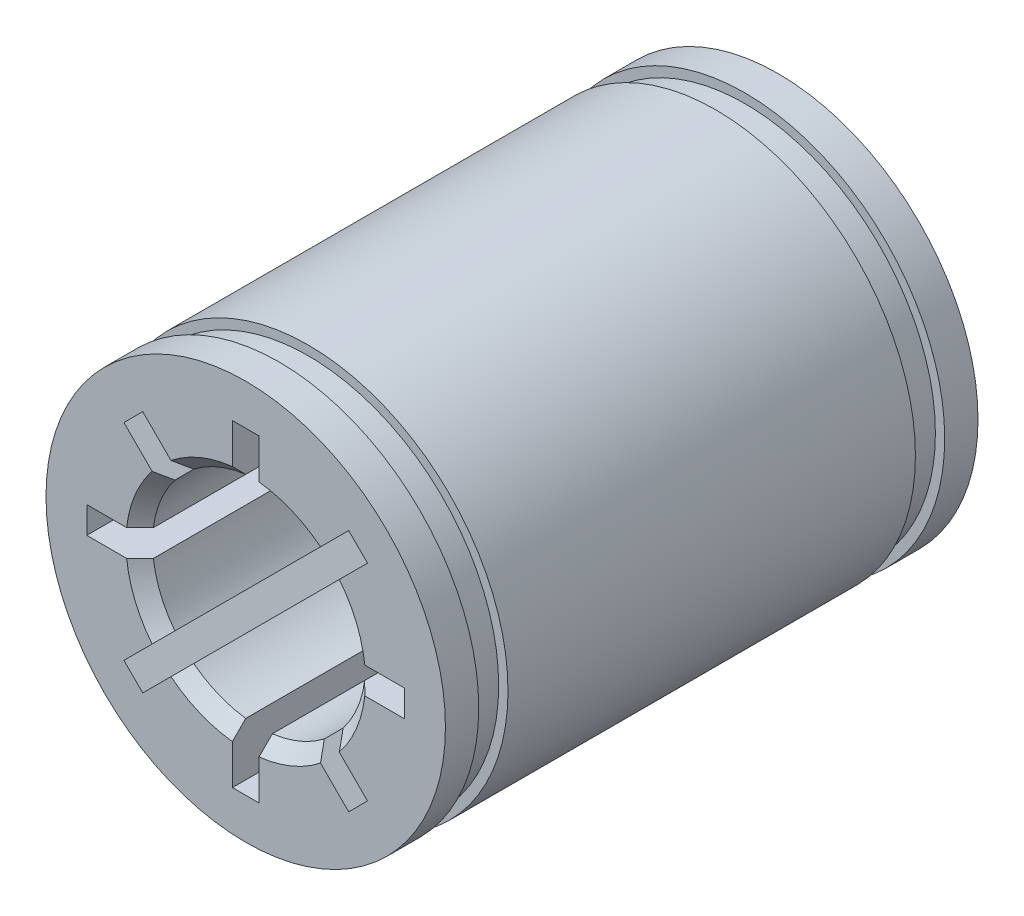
ISO-10303-21;
HEADER;
FILE_DESCRIPTION(('STEP AP214'),'2;1');
FILE_NAME('part.step','',(''),(''),'','','');
FILE_SCHEMA(('AUTOMOTIVE_DESIGN { 1 0 10303 214 1 1 1 1 }'));
ENDSEC;
DATA;
#1=APPLICATION_CONTEXT('core data for automotive mechanical design processes');
#2=APPLICATION_PROTOCOL_DEFINITION('international standard','automotive_design',2000,#1);
#3=PRODUCT_CONTEXT('',#1,'mechanical');
#4=PRODUCT('Part','Part','',(#3));
#5=PRODUCT_RELATED_PRODUCT_CATEGORY('part','',(#4));
#6=PRODUCT_DEFINITION_FORMATION('','',#4);
#7=PRODUCT_DEFINITION_CONTEXT('part definition',#1,'design');
#8=PRODUCT_DEFINITION('design','',#6,#7);
#9=PRODUCT_DEFINITION_SHAPE('','',#8);
#10=(LENGTH_UNIT() NAMED_UNIT(*) SI_UNIT(.MILLI.,.METRE.));
#11=(NAMED_UNIT(*) PLANE_ANGLE_UNIT() SI_UNIT($,.RADIAN.));
#12=(NAMED_UNIT(*) SI_UNIT($,.STERADIAN.) SOLID_ANGLE_UNIT());
#13=UNCERTAINTY_MEASURE_WITH_UNIT(LENGTH_MEASURE(1.E-05),#10,'distance_accuracy_value','');
#14=(GEOMETRIC_REPRESENTATION_CONTEXT(3) GLOBAL_UNCERTAINTY_ASSIGNED_CONTEXT((#13)) GLOBAL_UNIT_ASSIGNED_CONTEXT((#10,
#11,#12)) REPRESENTATION_CONTEXT('',''));
#15=CARTESIAN_POINT('',(0.,0.,0.));
#16=DIRECTION('',(0.,0.,1.));
#17=DIRECTION('',(1.,0.,0.));
#18=AXIS2_PLACEMENT_3D('',#15,#16,#17);
#19=CARTESIAN_POINT('',(0.,0.,10.));
#20=DIRECTION('',(0.,0.,-1.));
#21=DIRECTION('',(-1.,0.,0.));
#22=AXIS2_PLACEMENT_3D('',#19,#20,#21);
#23=CYLINDRICAL_SURFACE('',#22,7.5);
#24=CARTESIAN_POINT('',(0.,0.,7.65));
#25=DIRECTION('',(0.,0.,1.));
#26=DIRECTION('',(1.,0.,0.));
#27=AXIS2_PLACEMENT_3D('',#24,#25,#26);
#28=CIRCLE('',#27,7.5);
#29=CARTESIAN_POINT('',(7.5,0.,7.65));
#30=VERTEX_POINT('',#29);
#31=EDGE_CURVE('E748',#30,#30,#28,.T.);
#32=ORIENTED_EDGE('',*,*,#31,.F.);
#33=EDGE_LOOP('',(#32));
#34=FACE_BOUND('',#33,.T.);
#35=CARTESIAN_POINT('',(0.,0.,-7.65));
#36=DIRECTION('',(0.,0.,1.));
#37=DIRECTION('',(1.,0.,0.));
#38=AXIS2_PLACEMENT_3D('',#35,#36,#37);
#39=CIRCLE('',#38,7.5);
#40=CARTESIAN_POINT('',(7.5,0.,-7.65));
#41=VERTEX_POINT('',#40);
#42=EDGE_CURVE('E1510',#41,#41,#39,.T.);
#43=ORIENTED_EDGE('',*,*,#42,.T.);
#44=EDGE_LOOP('',(#43));
#45=FACE_BOUND('',#44,.T.);
#46=ADVANCED_FACE('F34',(#34,#45),#23,.T.);
#47=CARTESIAN_POINT('',(0.,0.,-10.));
#48=DIRECTION('',(0.,0.,1.));
#49=DIRECTION('',(1.,0.,0.));
#50=AXIS2_PLACEMENT_3D('',#47,#48,#49);
#51=CIRCLE('',#50,7.5);
#52=CARTESIAN_POINT('',(7.5,0.,-10.));
#53=VERTEX_POINT('',#52);
#54=EDGE_CURVE('E565',#53,#53,#51,.T.);
#55=ORIENTED_EDGE('',*,*,#54,.T.);
#56=EDGE_LOOP('',(#55));
#57=FACE_BOUND('',#56,.T.);
#58=CARTESIAN_POINT('',(0.,0.,-8.75));
#59=DIRECTION('',(0.,0.,1.));
#60=DIRECTION('',(1.,0.,0.));
#61=AXIS2_PLACEMENT_3D('',#58,#59,#60);
#62=CIRCLE('',#61,7.5);
#63=CARTESIAN_POINT('',(7.5,0.,-8.75));
#64=VERTEX_POINT('',#63);
#65=EDGE_CURVE('E1509',#64,#64,#62,.T.);
#66=ORIENTED_EDGE('',*,*,#65,.F.);
#67=EDGE_LOOP('',(#66));
#68=FACE_BOUND('',#67,.T.);
#69=ADVANCED_FACE('F724',(#57,#68),#23,.T.);
#70=CARTESIAN_POINT('',(0.,0.,10.));
#71=DIRECTION('',(0.,0.,1.));
#72=DIRECTION('',(1.,0.,0.));
#73=AXIS2_PLACEMENT_3D('',#70,#71,#72);
#74=CIRCLE('',#73,7.5);
#75=CARTESIAN_POINT('',(7.5,0.,10.));
#76=VERTEX_POINT('',#75);
#77=EDGE_CURVE('E566',#76,#76,#74,.T.);
#78=ORIENTED_EDGE('',*,*,#77,.F.);
#79=EDGE_LOOP('',(#78));
#80=FACE_BOUND('',#79,.T.);
#81=CARTESIAN_POINT('',(0.,0.,8.75));
#82=DIRECTION('',(0.,0.,1.));
#83=DIRECTION('',(1.,0.,0.));
#84=AXIS2_PLACEMENT_3D('',#81,#82,#83);
#85=CIRCLE('',#84,7.5);
#86=CARTESIAN_POINT('',(7.5,0.,8.75));
#87=VERTEX_POINT('',#86);
#88=EDGE_CURVE('E746',#87,#87,#85,.T.);
#89=ORIENTED_EDGE('',*,*,#88,.T.);
#90=EDGE_LOOP('',(#89));
#91=FACE_BOUND('',#90,.T.);
#92=ADVANCED_FACE('F727',(#80,#91),#23,.T.);
#93=CARTESIAN_POINT('',(0.,0.,10.));
#94=DIRECTION('',(0.,0.,1.));
#95=DIRECTION('',(1.,0.,0.));
#96=AXIS2_PLACEMENT_3D('',#93,#94,#95);
#97=PLANE('',#96);
#98=ORIENTED_EDGE('',*,*,#77,.T.);
#99=EDGE_LOOP('',(#98));
#100=FACE_BOUND('',#99,.T.);
#101=DIRECTION('',(-0.707106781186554,-0.707106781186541,0.));
#102=VECTOR('',#101,1.);
#103=CARTESIAN_POINT('',(-4.57400999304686,-3.86690321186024,10.));
#104=LINE('',#103,#102);
#105=CARTESIAN_POINT('',(-3.51583105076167,-2.80872426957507,10.));
#106=VERTEX_POINT('',#105);
#107=CARTESIAN_POINT('',(-4.57400999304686,-3.86690321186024,10.));
#108=VERTEX_POINT('',#107);
#109=EDGE_CURVE('E381',#106,#108,#104,.T.);
#110=ORIENTED_EDGE('',*,*,#109,.F.);
#111=CARTESIAN_POINT('',(0.,0.,10.));
#112=DIRECTION('',(0.,0.,1.));
#113=DIRECTION('',(1.,0.,0.));
#114=AXIS2_PLACEMENT_3D('',#111,#112,#113);
#115=CIRCLE('',#114,4.5);
#116=CARTESIAN_POINT('',(-4.47213595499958,-0.499999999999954,10.));
#117=VERTEX_POINT('',#116);
#118=EDGE_CURVE('E614',#106,#117,#115,.F.);
#119=ORIENTED_EDGE('',*,*,#118,.T.);
#120=DIRECTION('',(1.,0.,0.));
#121=VECTOR('',#120,1.);
#122=CARTESIAN_POINT('',(-5.96862696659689,-0.499999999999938,10.));
#123=LINE('',#122,#121);
#124=CARTESIAN_POINT('',(-5.96862696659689,-0.499999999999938,10.));
#125=VERTEX_POINT('',#124);
#126=EDGE_CURVE('E378',#125,#117,#123,.T.);
#127=ORIENTED_EDGE('',*,*,#126,.F.);
#128=DIRECTION('',(0.,-1.,0.));
#129=VECTOR('',#128,1.);
#130=CARTESIAN_POINT('',(-5.96862696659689,-0.499999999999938,10.));
#131=LINE('',#130,#129);
#132=CARTESIAN_POINT('',(-5.96862696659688,0.500000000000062,10.));
#133=VERTEX_POINT('',#132);
#134=EDGE_CURVE('E376',#133,#125,#131,.T.);
#135=ORIENTED_EDGE('',*,*,#134,.F.);
#136=DIRECTION('',(-1.,0.,0.));
#137=VECTOR('',#136,1.);
#138=CARTESIAN_POINT('',(-5.96862696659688,0.500000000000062,10.));
#139=LINE('',#138,#137);
#140=CARTESIAN_POINT('',(-4.47213595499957,0.500000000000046,10.));
#141=VERTEX_POINT('',#140);
#142=EDGE_CURVE('E371',#141,#133,#139,.T.);
#143=ORIENTED_EDGE('',*,*,#142,.F.);
#144=CARTESIAN_POINT('',(0.,0.,10.));
#145=DIRECTION('',(0.,0.,1.));
#146=DIRECTION('',(1.,0.,0.));
#147=AXIS2_PLACEMENT_3D('',#144,#145,#146);
#148=CIRCLE('',#147,4.49999999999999);
#149=CARTESIAN_POINT('',(-3.51583105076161,2.80872426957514,10.));
#150=VERTEX_POINT('',#149);
#151=EDGE_CURVE('E944',#141,#150,#148,.F.);
#152=ORIENTED_EDGE('',*,*,#151,.T.);
#153=DIRECTION('',(0.707106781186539,-0.707106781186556,0.));
#154=VECTOR('',#153,1.);
#155=CARTESIAN_POINT('',(-4.57400999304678,3.86690321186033,10.));
#156=LINE('',#155,#154);
#157=CARTESIAN_POINT('',(-4.57400999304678,3.86690321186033,10.));
#158=VERTEX_POINT('',#157);
#159=EDGE_CURVE('E369',#158,#150,#156,.T.);
#160=ORIENTED_EDGE('',*,*,#159,.F.);
#161=DIRECTION('',(-0.707106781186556,-0.707106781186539,0.));
#162=VECTOR('',#161,1.);
#163=CARTESIAN_POINT('',(-4.57400999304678,3.86690321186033,10.));
#164=LINE('',#163,#162);
#165=CARTESIAN_POINT('',(-3.86690321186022,4.57400999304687,10.));
#166=VERTEX_POINT('',#165);
#167=EDGE_CURVE('E354',#166,#158,#164,.T.);
#168=ORIENTED_EDGE('',*,*,#167,.F.);
#169=DIRECTION('',(-0.707106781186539,0.707106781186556,0.));
#170=VECTOR('',#169,1.);
#171=CARTESIAN_POINT('',(-3.86690321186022,4.57400999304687,10.));
#172=LINE('',#171,#170);
#173=CARTESIAN_POINT('',(-2.80872426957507,3.51583105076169,10.));
#174=VERTEX_POINT('',#173);
#175=EDGE_CURVE('E343',#174,#166,#172,.T.);
#176=ORIENTED_EDGE('',*,*,#175,.F.);
#177=CARTESIAN_POINT('',(0.,0.,10.));
#178=DIRECTION('',(0.,0.,1.));
#179=DIRECTION('',(1.,0.,0.));
#180=AXIS2_PLACEMENT_3D('',#177,#178,#179);
#181=CIRCLE('',#180,4.5);
#182=CARTESIAN_POINT('',(-0.500000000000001,4.47213595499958,10.));
#183=VERTEX_POINT('',#182);
#184=EDGE_CURVE('E771',#174,#183,#181,.F.);
#185=ORIENTED_EDGE('',*,*,#184,.T.);
#186=DIRECTION('',(0.,-1.,0.));
#187=VECTOR('',#186,1.);
#188=CARTESIAN_POINT('',(-0.500000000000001,5.96862696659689,10.));
#189=LINE('',#188,#187);
#190=CARTESIAN_POINT('',(-0.500000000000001,5.96862696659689,10.));
#191=VERTEX_POINT('',#190);
#192=EDGE_CURVE('E355',#191,#183,#189,.T.);
#193=ORIENTED_EDGE('',*,*,#192,.F.);
#194=DIRECTION('',(-1.,0.,0.));
#195=VECTOR('',#194,1.);
#196=CARTESIAN_POINT('',(-0.500000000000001,5.96862696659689,10.));
#197=LINE('',#196,#195);
#198=CARTESIAN_POINT('',(0.499999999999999,5.96862696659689,10.));
#199=VERTEX_POINT('',#198);
#200=EDGE_CURVE('E418',#199,#191,#197,.T.);
#201=ORIENTED_EDGE('',*,*,#200,.F.);
#202=DIRECTION('',(0.,1.,0.));
#203=VECTOR('',#202,1.);
#204=CARTESIAN_POINT('',(0.499999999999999,5.96862696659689,10.));
#205=LINE('',#204,#203);
#206=CARTESIAN_POINT('',(0.499999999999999,4.47213595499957,10.));
#207=VERTEX_POINT('',#206);
#208=EDGE_CURVE('E416',#207,#199,#205,.T.);
#209=ORIENTED_EDGE('',*,*,#208,.F.);
#210=CARTESIAN_POINT('',(0.,0.,10.));
#211=DIRECTION('',(0.,0.,1.));
#212=DIRECTION('',(1.,0.,0.));
#213=AXIS2_PLACEMENT_3D('',#210,#211,#212);
#214=CIRCLE('',#213,4.49999999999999);
#215=CARTESIAN_POINT('',(2.80872426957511,3.51583105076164,10.));
#216=VERTEX_POINT('',#215);
#217=EDGE_CURVE('E939',#207,#216,#214,.F.);
#218=ORIENTED_EDGE('',*,*,#217,.T.);
#219=DIRECTION('',(-0.707106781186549,-0.707106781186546,0.));
#220=VECTOR('',#219,1.);
#221=CARTESIAN_POINT('',(3.86690321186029,4.57400999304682,10.));
#222=LINE('',#221,#220);
#223=CARTESIAN_POINT('',(3.86690321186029,4.57400999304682,10.));
#224=VERTEX_POINT('',#223);
#225=EDGE_CURVE('E413',#224,#216,#222,.T.);
#226=ORIENTED_EDGE('',*,*,#225,.F.);
#227=DIRECTION('',(-0.707106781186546,0.70710678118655,0.));
#228=VECTOR('',#227,1.);
#229=CARTESIAN_POINT('',(3.86690321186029,4.57400999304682,10.));
#230=LINE('',#229,#228);
#231=CARTESIAN_POINT('',(4.57400999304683,3.86690321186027,10.));
#232=VERTEX_POINT('',#231);
#233=EDGE_CURVE('E411',#232,#224,#230,.T.);
#234=ORIENTED_EDGE('',*,*,#233,.F.);
#235=DIRECTION('',(0.707106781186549,0.707106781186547,0.));
#236=VECTOR('',#235,1.);
#237=CARTESIAN_POINT('',(4.57400999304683,3.86690321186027,10.));
#238=LINE('',#237,#236);
#239=CARTESIAN_POINT('',(3.51583105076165,2.8087242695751,10.));
#240=VERTEX_POINT('',#239);
#241=EDGE_CURVE('E409',#240,#232,#238,.T.);
#242=ORIENTED_EDGE('',*,*,#241,.F.);
#243=CARTESIAN_POINT('',(0.,0.,10.));
#244=DIRECTION('',(0.,0.,1.));
#245=DIRECTION('',(1.,0.,0.));
#246=AXIS2_PLACEMENT_3D('',#243,#244,#245);
#247=CIRCLE('',#246,4.5);
#248=CARTESIAN_POINT('',(4.47213595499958,0.499999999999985,10.));
#249=VERTEX_POINT('',#248);
#250=EDGE_CURVE('E940',#240,#249,#247,.F.);
#251=ORIENTED_EDGE('',*,*,#250,.T.);
#252=DIRECTION('',(-1.,0.,0.));
#253=VECTOR('',#252,1.);
#254=CARTESIAN_POINT('',(5.96862696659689,0.49999999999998,10.));
#255=LINE('',#254,#253);
#256=CARTESIAN_POINT('',(5.96862696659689,0.49999999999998,10.));
#257=VERTEX_POINT('',#256);
#258=EDGE_CURVE('E406',#257,#249,#255,.T.);
#259=ORIENTED_EDGE('',*,*,#258,.F.);
#260=DIRECTION('',(0.,1.,0.));
#261=VECTOR('',#260,1.);
#262=CARTESIAN_POINT('',(5.96862696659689,0.49999999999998,10.));
#263=LINE('',#262,#261);
#264=CARTESIAN_POINT('',(5.96862696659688,-0.50000000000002,10.));
#265=VERTEX_POINT('',#264);
#266=EDGE_CURVE('E404',#265,#257,#263,.T.);
#267=ORIENTED_EDGE('',*,*,#266,.F.);
#268=DIRECTION('',(1.,0.,0.));
#269=VECTOR('',#268,1.);
#270=CARTESIAN_POINT('',(5.96862696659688,-0.50000000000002,10.));
#271=LINE('',#270,#269);
#272=CARTESIAN_POINT('',(4.47213595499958,-0.500000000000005,10.));
#273=VERTEX_POINT('',#272);
#274=EDGE_CURVE('E402',#273,#265,#271,.T.);
#275=ORIENTED_EDGE('',*,*,#274,.F.);
#276=CARTESIAN_POINT('',(0.,0.,10.));
#277=DIRECTION('',(0.,0.,1.));
#278=DIRECTION('',(1.,0.,0.));
#279=AXIS2_PLACEMENT_3D('',#276,#277,#278);
#280=CIRCLE('',#279,4.5);
#281=CARTESIAN_POINT('',(3.51583105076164,-2.80872426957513,10.));
#282=VERTEX_POINT('',#281);
#283=EDGE_CURVE('E942',#273,#282,#280,.F.);
#284=ORIENTED_EDGE('',*,*,#283,.T.);
#285=DIRECTION('',(-0.707106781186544,0.707106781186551,0.));
#286=VECTOR('',#285,1.);
#287=CARTESIAN_POINT('',(4.57400999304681,-3.8669032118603,10.));
#288=LINE('',#287,#286);
#289=CARTESIAN_POINT('',(4.57400999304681,-3.8669032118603,10.));
#290=VERTEX_POINT('',#289);
#291=EDGE_CURVE('E399',#290,#282,#288,.T.);
#292=ORIENTED_EDGE('',*,*,#291,.F.);
#293=DIRECTION('',(0.707106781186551,0.707106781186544,0.));
#294=VECTOR('',#293,1.);
#295=CARTESIAN_POINT('',(4.57400999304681,-3.8669032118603,10.));
#296=LINE('',#295,#294);
#297=CARTESIAN_POINT('',(3.86690321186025,-4.57400999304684,10.));
#298=VERTEX_POINT('',#297);
#299=EDGE_CURVE('E397',#298,#290,#296,.T.);
#300=ORIENTED_EDGE('',*,*,#299,.F.);
#301=DIRECTION('',(0.707106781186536,-0.707106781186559,0.));
#302=VECTOR('',#301,1.);
#303=CARTESIAN_POINT('',(3.86690321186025,-4.57400999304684,10.));
#304=LINE('',#303,#302);
#305=CARTESIAN_POINT('',(2.8087242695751,-3.51583105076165,10.));
#306=VERTEX_POINT('',#305);
#307=EDGE_CURVE('E395',#306,#298,#304,.T.);
#308=ORIENTED_EDGE('',*,*,#307,.F.);
#309=CARTESIAN_POINT('',(0.,0.,10.));
#310=DIRECTION('',(0.,0.,1.));
#311=DIRECTION('',(1.,0.,0.));
#312=AXIS2_PLACEMENT_3D('',#309,#310,#311);
#313=CIRCLE('',#312,4.49999999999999);
#314=CARTESIAN_POINT('',(0.499999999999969,-4.47213595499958,10.));
#315=VERTEX_POINT('',#314);
#316=EDGE_CURVE('E948',#306,#315,#313,.F.);
#317=ORIENTED_EDGE('',*,*,#316,.T.);
#318=DIRECTION('',(0.,1.,0.));
#319=VECTOR('',#318,1.);
#320=CARTESIAN_POINT('',(0.499999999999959,-5.96862696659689,10.));
#321=LINE('',#320,#319);
#322=CARTESIAN_POINT('',(0.499999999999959,-5.96862696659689,10.));
#323=VERTEX_POINT('',#322);
#324=EDGE_CURVE('E392',#323,#315,#321,.T.);
#325=ORIENTED_EDGE('',*,*,#324,.F.);
#326=DIRECTION('',(1.,0.,0.));
#327=VECTOR('',#326,1.);
#328=CARTESIAN_POINT('',(0.499999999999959,-5.96862696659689,10.));
#329=LINE('',#328,#327);
#330=CARTESIAN_POINT('',(-0.500000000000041,-5.96862696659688,10.));
#331=VERTEX_POINT('',#330);
#332=EDGE_CURVE('E390',#331,#323,#329,.T.);
#333=ORIENTED_EDGE('',*,*,#332,.F.);
#334=DIRECTION('',(0.,-1.,0.));
#335=VECTOR('',#334,1.);
#336=CARTESIAN_POINT('',(-0.500000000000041,-5.96862696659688,10.));
#337=LINE('',#336,#335);
#338=CARTESIAN_POINT('',(-0.500000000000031,-4.47213595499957,10.));
#339=VERTEX_POINT('',#338);
#340=EDGE_CURVE('E388',#339,#331,#337,.T.);
#341=ORIENTED_EDGE('',*,*,#340,.F.);
#342=CARTESIAN_POINT('',(0.,0.,10.));
#343=DIRECTION('',(0.,0.,1.));
#344=DIRECTION('',(1.,0.,0.));
#345=AXIS2_PLACEMENT_3D('',#342,#343,#344);
#346=CIRCLE('',#345,4.5);
#347=CARTESIAN_POINT('',(-2.80872426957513,-3.51583105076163,10.));
#348=VERTEX_POINT('',#347);
#349=EDGE_CURVE('E949',#339,#348,#346,.F.);
#350=ORIENTED_EDGE('',*,*,#349,.T.);
#351=DIRECTION('',(0.707106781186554,0.707106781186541,0.));
#352=VECTOR('',#351,1.);
#353=CARTESIAN_POINT('',(-3.86690321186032,-4.57400999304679,10.));
#354=LINE('',#353,#352);
#355=CARTESIAN_POINT('',(-3.86690321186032,-4.57400999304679,10.));
#356=VERTEX_POINT('',#355);
#357=EDGE_CURVE('E385',#356,#348,#354,.T.);
#358=ORIENTED_EDGE('',*,*,#357,.F.);
#359=DIRECTION('',(0.707106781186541,-0.707106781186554,0.));
#360=VECTOR('',#359,1.);
#361=CARTESIAN_POINT('',(-3.86690321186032,-4.57400999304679,10.));
#362=LINE('',#361,#360);
#363=EDGE_CURVE('E383',#108,#356,#362,.T.);
#364=ORIENTED_EDGE('',*,*,#363,.F.);
#365=EDGE_LOOP('',(#110,#119,#127,#135,#143,#152,#160,#168,#176,#185,#193,#201,#209,#218,#226,
#234,#242,#251,#259,#267,#275,#284,#292,#300,#308,#317,#325,#333,#341,#350,#358,#364));
#366=FACE_BOUND('',#365,.T.);
#367=ADVANCED_FACE('F367',(#100,#366),#97,.T.);
#368=CARTESIAN_POINT('',(0.,0.,-10.));
#369=DIRECTION('',(0.,0.,1.));
#370=DIRECTION('',(1.,0.,0.));
#371=AXIS2_PLACEMENT_3D('',#368,#369,#370);
#372=PLANE('',#371);
#373=ORIENTED_EDGE('',*,*,#54,.F.);
#374=EDGE_LOOP('',(#373));
#375=FACE_BOUND('',#374,.T.);
#376=DIRECTION('',(-1.,0.,0.));
#377=VECTOR('',#376,1.);
#378=CARTESIAN_POINT('',(5.96862696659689,0.49999999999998,-10.));
#379=LINE('',#378,#377);
#380=CARTESIAN_POINT('',(5.96862696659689,0.49999999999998,-10.));
#381=VERTEX_POINT('',#380);
#382=CARTESIAN_POINT('',(4.47213595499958,0.499999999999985,-10.));
#383=VERTEX_POINT('',#382);
#384=EDGE_CURVE('E467',#381,#383,#379,.T.);
#385=ORIENTED_EDGE('',*,*,#384,.T.);
#386=CARTESIAN_POINT('',(0.,0.,-10.));
#387=DIRECTION('',(0.,0.,1.));
#388=DIRECTION('',(1.,0.,0.));
#389=AXIS2_PLACEMENT_3D('',#386,#387,#388);
#390=CIRCLE('',#389,4.5);
#391=CARTESIAN_POINT('',(3.51583105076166,2.8087242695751,-10.));
#392=VERTEX_POINT('',#391);
#393=EDGE_CURVE('E11',#383,#392,#390,.T.);
#394=ORIENTED_EDGE('',*,*,#393,.T.);
#395=DIRECTION('',(0.707106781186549,0.707106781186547,0.));
#396=VECTOR('',#395,1.);
#397=CARTESIAN_POINT('',(4.57400999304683,3.86690321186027,-10.));
#398=LINE('',#397,#396);
#399=CARTESIAN_POINT('',(4.57400999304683,3.86690321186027,-10.));
#400=VERTEX_POINT('',#399);
#401=EDGE_CURVE('E470',#392,#400,#398,.T.);
#402=ORIENTED_EDGE('',*,*,#401,.T.);
#403=DIRECTION('',(-0.707106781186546,0.70710678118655,0.));
#404=VECTOR('',#403,1.);
#405=CARTESIAN_POINT('',(3.86690321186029,4.57400999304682,-10.));
#406=LINE('',#405,#404);
#407=CARTESIAN_POINT('',(3.86690321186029,4.57400999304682,-10.));
#408=VERTEX_POINT('',#407);
#409=EDGE_CURVE('E472',#400,#408,#406,.T.);
#410=ORIENTED_EDGE('',*,*,#409,.T.);
#411=DIRECTION('',(-0.707106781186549,-0.707106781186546,0.));
#412=VECTOR('',#411,1.);
#413=CARTESIAN_POINT('',(3.86690321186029,4.57400999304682,-10.));
#414=LINE('',#413,#412);
#415=CARTESIAN_POINT('',(2.80872426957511,3.51583105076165,-10.));
#416=VERTEX_POINT('',#415);
#417=EDGE_CURVE('E475',#408,#416,#414,.T.);
#418=ORIENTED_EDGE('',*,*,#417,.T.);
#419=CARTESIAN_POINT('',(0.,0.,-10.));
#420=DIRECTION('',(0.,0.,1.));
#421=DIRECTION('',(1.,0.,0.));
#422=AXIS2_PLACEMENT_3D('',#419,#420,#421);
#423=CIRCLE('',#422,4.5);
#424=CARTESIAN_POINT('',(0.499999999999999,4.47213595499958,-10.));
#425=VERTEX_POINT('',#424);
#426=EDGE_CURVE('E673',#416,#425,#423,.T.);
#427=ORIENTED_EDGE('',*,*,#426,.T.);
#428=DIRECTION('',(0.,1.,0.));
#429=VECTOR('',#428,1.);
#430=CARTESIAN_POINT('',(0.499999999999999,5.96862696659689,-10.));
#431=LINE('',#430,#429);
#432=CARTESIAN_POINT('',(0.499999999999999,5.96862696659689,-10.));
#433=VERTEX_POINT('',#432);
#434=EDGE_CURVE('E478',#425,#433,#431,.T.);
#435=ORIENTED_EDGE('',*,*,#434,.T.);
#436=DIRECTION('',(-1.,0.,0.));
#437=VECTOR('',#436,1.);
#438=CARTESIAN_POINT('',(-0.500000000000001,5.96862696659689,-10.));
#439=LINE('',#438,#437);
#440=CARTESIAN_POINT('',(-0.500000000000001,5.96862696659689,-10.));
#441=VERTEX_POINT('',#440);
#442=EDGE_CURVE('E480',#433,#441,#439,.T.);
#443=ORIENTED_EDGE('',*,*,#442,.T.);
#444=DIRECTION('',(0.,-1.,0.));
#445=VECTOR('',#444,1.);
#446=CARTESIAN_POINT('',(-0.500000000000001,5.96862696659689,-10.));
#447=LINE('',#446,#445);
#448=CARTESIAN_POINT('',(-0.500000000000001,4.47213595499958,-10.));
#449=VERTEX_POINT('',#448);
#450=EDGE_CURVE('E421',#441,#449,#447,.T.);
#451=ORIENTED_EDGE('',*,*,#450,.T.);
#452=CARTESIAN_POINT('',(0.,0.,-10.));
#453=DIRECTION('',(0.,0.,1.));
#454=DIRECTION('',(1.,0.,0.));
#455=AXIS2_PLACEMENT_3D('',#452,#453,#454);
#456=CIRCLE('',#455,4.5);
#457=CARTESIAN_POINT('',(-2.80872426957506,3.51583105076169,-10.));
#458=VERTEX_POINT('',#457);
#459=EDGE_CURVE('E785',#449,#458,#456,.T.);
#460=ORIENTED_EDGE('',*,*,#459,.T.);
#461=DIRECTION('',(-0.707106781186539,0.707106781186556,0.));
#462=VECTOR('',#461,1.);
#463=CARTESIAN_POINT('',(-3.86690321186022,4.57400999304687,-10.));
#464=LINE('',#463,#462);
#465=CARTESIAN_POINT('',(-3.86690321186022,4.57400999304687,-10.));
#466=VERTEX_POINT('',#465);
#467=EDGE_CURVE('E424',#458,#466,#464,.T.);
#468=ORIENTED_EDGE('',*,*,#467,.T.);
#469=DIRECTION('',(-0.707106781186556,-0.707106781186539,0.));
#470=VECTOR('',#469,1.);
#471=CARTESIAN_POINT('',(-4.57400999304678,3.86690321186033,-10.));
#472=LINE('',#471,#470);
#473=CARTESIAN_POINT('',(-4.57400999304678,3.86690321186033,-10.));
#474=VERTEX_POINT('',#473);
#475=EDGE_CURVE('E361',#466,#474,#472,.T.);
#476=ORIENTED_EDGE('',*,*,#475,.T.);
#477=DIRECTION('',(0.707106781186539,-0.707106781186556,0.));
#478=VECTOR('',#477,1.);
#479=CARTESIAN_POINT('',(-4.57400999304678,3.86690321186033,-10.));
#480=LINE('',#479,#478);
#481=CARTESIAN_POINT('',(-3.51583105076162,2.80872426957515,-10.));
#482=VERTEX_POINT('',#481);
#483=EDGE_CURVE('E428',#474,#482,#480,.T.);
#484=ORIENTED_EDGE('',*,*,#483,.T.);
#485=CARTESIAN_POINT('',(0.,0.,-10.));
#486=DIRECTION('',(0.,0.,1.));
#487=DIRECTION('',(1.,0.,0.));
#488=AXIS2_PLACEMENT_3D('',#485,#486,#487);
#489=CIRCLE('',#488,4.5);
#490=CARTESIAN_POINT('',(-4.47213595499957,0.500000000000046,-10.));
#491=VERTEX_POINT('',#490);
#492=EDGE_CURVE('E782',#482,#491,#489,.T.);
#493=ORIENTED_EDGE('',*,*,#492,.T.);
#494=DIRECTION('',(-1.,0.,0.));
#495=VECTOR('',#494,1.);
#496=CARTESIAN_POINT('',(-5.96862696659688,0.500000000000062,-10.));
#497=LINE('',#496,#495);
#498=CARTESIAN_POINT('',(-5.96862696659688,0.500000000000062,-10.));
#499=VERTEX_POINT('',#498);
#500=EDGE_CURVE('E430',#491,#499,#497,.T.);
#501=ORIENTED_EDGE('',*,*,#500,.T.);
#502=DIRECTION('',(0.,-1.,0.));
#503=VECTOR('',#502,1.);
#504=CARTESIAN_POINT('',(-5.96862696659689,-0.499999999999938,-10.));
#505=LINE('',#504,#503);
#506=CARTESIAN_POINT('',(-5.96862696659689,-0.499999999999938,-10.));
#507=VERTEX_POINT('',#506);
#508=EDGE_CURVE('E432',#499,#507,#505,.T.);
#509=ORIENTED_EDGE('',*,*,#508,.T.);
#510=DIRECTION('',(1.,0.,0.));
#511=VECTOR('',#510,1.);
#512=CARTESIAN_POINT('',(-5.96862696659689,-0.499999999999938,-10.));
#513=LINE('',#512,#511);
#514=CARTESIAN_POINT('',(-4.47213595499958,-0.499999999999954,-10.));
#515=VERTEX_POINT('',#514);
#516=EDGE_CURVE('E435',#507,#515,#513,.T.);
#517=ORIENTED_EDGE('',*,*,#516,.T.);
#518=CARTESIAN_POINT('',(0.,0.,-10.));
#519=DIRECTION('',(0.,0.,1.));
#520=DIRECTION('',(1.,0.,0.));
#521=AXIS2_PLACEMENT_3D('',#518,#519,#520);
#522=CIRCLE('',#521,4.5);
#523=CARTESIAN_POINT('',(-3.51583105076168,-2.80872426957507,-10.));
#524=VERTEX_POINT('',#523);
#525=EDGE_CURVE('E784',#515,#524,#522,.T.);
#526=ORIENTED_EDGE('',*,*,#525,.T.);
#527=DIRECTION('',(-0.707106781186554,-0.707106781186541,0.));
#528=VECTOR('',#527,1.);
#529=CARTESIAN_POINT('',(-4.57400999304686,-3.86690321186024,-10.));
#530=LINE('',#529,#528);
#531=CARTESIAN_POINT('',(-4.57400999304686,-3.86690321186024,-10.));
#532=VERTEX_POINT('',#531);
#533=EDGE_CURVE('E438',#524,#532,#530,.T.);
#534=ORIENTED_EDGE('',*,*,#533,.T.);
#535=DIRECTION('',(0.707106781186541,-0.707106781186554,0.));
#536=VECTOR('',#535,1.);
#537=CARTESIAN_POINT('',(-3.86690321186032,-4.57400999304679,-10.));
#538=LINE('',#537,#536);
#539=CARTESIAN_POINT('',(-3.86690321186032,-4.57400999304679,-10.));
#540=VERTEX_POINT('',#539);
#541=EDGE_CURVE('E440',#532,#540,#538,.T.);
#542=ORIENTED_EDGE('',*,*,#541,.T.);
#543=DIRECTION('',(0.707106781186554,0.707106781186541,0.));
#544=VECTOR('',#543,1.);
#545=CARTESIAN_POINT('',(-3.86690321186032,-4.57400999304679,-10.));
#546=LINE('',#545,#544);
#547=CARTESIAN_POINT('',(-2.80872426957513,-3.51583105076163,-10.));
#548=VERTEX_POINT('',#547);
#549=EDGE_CURVE('E443',#540,#548,#546,.T.);
#550=ORIENTED_EDGE('',*,*,#549,.T.);
#551=CARTESIAN_POINT('',(0.,0.,-10.));
#552=DIRECTION('',(0.,0.,1.));
#553=DIRECTION('',(1.,0.,0.));
#554=AXIS2_PLACEMENT_3D('',#551,#552,#553);
#555=CIRCLE('',#554,4.5);
#556=CARTESIAN_POINT('',(-0.500000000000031,-4.47213595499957,-10.));
#557=VERTEX_POINT('',#556);
#558=EDGE_CURVE('E788',#548,#557,#555,.T.);
#559=ORIENTED_EDGE('',*,*,#558,.T.);
#560=DIRECTION('',(0.,-1.,0.));
#561=VECTOR('',#560,1.);
#562=CARTESIAN_POINT('',(-0.500000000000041,-5.96862696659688,-10.));
#563=LINE('',#562,#561);
#564=CARTESIAN_POINT('',(-0.500000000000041,-5.96862696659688,-10.));
#565=VERTEX_POINT('',#564);
#566=EDGE_CURVE('E446',#557,#565,#563,.T.);
#567=ORIENTED_EDGE('',*,*,#566,.T.);
#568=DIRECTION('',(1.,0.,0.));
#569=VECTOR('',#568,1.);
#570=CARTESIAN_POINT('',(0.499999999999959,-5.96862696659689,-10.));
#571=LINE('',#570,#569);
#572=CARTESIAN_POINT('',(0.499999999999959,-5.96862696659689,-10.));
#573=VERTEX_POINT('',#572);
#574=EDGE_CURVE('E448',#565,#573,#571,.T.);
#575=ORIENTED_EDGE('',*,*,#574,.T.);
#576=DIRECTION('',(0.,1.,0.));
#577=VECTOR('',#576,1.);
#578=CARTESIAN_POINT('',(0.499999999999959,-5.96862696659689,-10.));
#579=LINE('',#578,#577);
#580=CARTESIAN_POINT('',(0.499999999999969,-4.47213595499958,-10.));
#581=VERTEX_POINT('',#580);
#582=EDGE_CURVE('E451',#573,#581,#579,.T.);
#583=ORIENTED_EDGE('',*,*,#582,.T.);
#584=CARTESIAN_POINT('',(0.,0.,-10.));
#585=DIRECTION('',(0.,0.,1.));
#586=DIRECTION('',(1.,0.,0.));
#587=AXIS2_PLACEMENT_3D('',#584,#585,#586);
#588=CIRCLE('',#587,4.5);
#589=CARTESIAN_POINT('',(2.8087242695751,-3.51583105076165,-10.));
#590=VERTEX_POINT('',#589);
#591=EDGE_CURVE('E794',#581,#590,#588,.T.);
#592=ORIENTED_EDGE('',*,*,#591,.T.);
#593=DIRECTION('',(0.707106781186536,-0.707106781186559,0.));
#594=VECTOR('',#593,1.);
#595=CARTESIAN_POINT('',(3.86690321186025,-4.57400999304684,-10.));
#596=LINE('',#595,#594);
#597=CARTESIAN_POINT('',(3.86690321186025,-4.57400999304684,-10.));
#598=VERTEX_POINT('',#597);
#599=EDGE_CURVE('E454',#590,#598,#596,.T.);
#600=ORIENTED_EDGE('',*,*,#599,.T.);
#601=DIRECTION('',(0.707106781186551,0.707106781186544,0.));
#602=VECTOR('',#601,1.);
#603=CARTESIAN_POINT('',(4.57400999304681,-3.8669032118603,-10.));
#604=LINE('',#603,#602);
#605=CARTESIAN_POINT('',(4.57400999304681,-3.8669032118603,-10.));
#606=VERTEX_POINT('',#605);
#607=EDGE_CURVE('E456',#598,#606,#604,.T.);
#608=ORIENTED_EDGE('',*,*,#607,.T.);
#609=DIRECTION('',(-0.707106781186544,0.707106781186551,0.));
#610=VECTOR('',#609,1.);
#611=CARTESIAN_POINT('',(4.57400999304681,-3.8669032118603,-10.));
#612=LINE('',#611,#610);
#613=CARTESIAN_POINT('',(3.51583105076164,-2.80872426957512,-10.));
#614=VERTEX_POINT('',#613);
#615=EDGE_CURVE('E459',#606,#614,#612,.T.);
#616=ORIENTED_EDGE('',*,*,#615,.T.);
#617=CARTESIAN_POINT('',(0.,0.,-10.));
#618=DIRECTION('',(0.,0.,1.));
#619=DIRECTION('',(1.,0.,0.));
#620=AXIS2_PLACEMENT_3D('',#617,#618,#619);
#621=CIRCLE('',#620,4.5);
#622=CARTESIAN_POINT('',(4.47213595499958,-0.500000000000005,-10.));
#623=VERTEX_POINT('',#622);
#624=EDGE_CURVE('E43',#614,#623,#621,.T.);
#625=ORIENTED_EDGE('',*,*,#624,.T.);
#626=DIRECTION('',(1.,0.,0.));
#627=VECTOR('',#626,1.);
#628=CARTESIAN_POINT('',(5.96862696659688,-0.50000000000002,-10.));
#629=LINE('',#628,#627);
#630=CARTESIAN_POINT('',(5.96862696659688,-0.50000000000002,-10.));
#631=VERTEX_POINT('',#630);
#632=EDGE_CURVE('E462',#623,#631,#629,.T.);
#633=ORIENTED_EDGE('',*,*,#632,.T.);
#634=DIRECTION('',(0.,1.,0.));
#635=VECTOR('',#634,1.);
#636=CARTESIAN_POINT('',(5.96862696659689,0.49999999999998,-10.));
#637=LINE('',#636,#635);
#638=EDGE_CURVE('E464',#631,#381,#637,.T.);
#639=ORIENTED_EDGE('',*,*,#638,.T.);
#640=EDGE_LOOP('',(#385,#394,#402,#410,#418,#427,#435,#443,#451,#460,#468,#476,#484,#493,#501,
#509,#517,#526,#534,#542,#550,#559,#567,#575,#583,#592,#600,#608,#616,#625,#633,#639));
#641=FACE_BOUND('',#640,.T.);
#642=ADVANCED_FACE('F740',(#375,#641),#372,.F.);
#643=CARTESIAN_POINT('',(-0.500000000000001,5.96862696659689,10.));
#644=DIRECTION('',(1.,0.,0.));
#645=DIRECTION('',(0.,1.,0.));
#646=AXIS2_PLACEMENT_3D('',#643,#644,#645);
#647=PLANE('',#646);
#648=ORIENTED_EDGE('',*,*,#192,.T.);
#649=CARTESIAN_POINT('',(-0.500000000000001,4.47213595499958,10.));
#650=CARTESIAN_POINT('',(-0.500000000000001,4.38825231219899,9.91663190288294));
#651=CARTESIAN_POINT('',(-0.500000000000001,4.30435140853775,9.83328118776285));
#652=CARTESIAN_POINT('',(-0.500000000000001,4.13651507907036,9.666614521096));
#653=CARTESIAN_POINT('',(-0.500000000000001,4.05257965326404,9.58329856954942));
#654=CARTESIAN_POINT('',(-0.500000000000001,3.96862696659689,9.5));
#655=B_SPLINE_CURVE_WITH_KNOTS('',3,(#649,#650,#651,#652,#653,#654),.UNSPECIFIED.,.F.,.F.,(4,2,
4),(0.,0.354796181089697,0.709592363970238),.UNSPECIFIED.);
#656=CARTESIAN_POINT('',(-0.500000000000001,3.96862696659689,9.5));
#657=VERTEX_POINT('',#656);
#658=EDGE_CURVE('E704',#183,#657,#655,.T.);
#659=ORIENTED_EDGE('',*,*,#658,.T.);
#660=DIRECTION('',(0.,0.,-1.));
#661=VECTOR('',#660,1.);
#662=CARTESIAN_POINT('',(-0.500000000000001,3.96862696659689,10.));
#663=LINE('',#662,#661);
#664=CARTESIAN_POINT('',(-0.500000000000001,3.96862696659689,-9.5));
#665=VERTEX_POINT('',#664);
#666=EDGE_CURVE('E562',#657,#665,#663,.T.);
#667=ORIENTED_EDGE('',*,*,#666,.T.);
#668=CARTESIAN_POINT('',(-0.500000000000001,3.96862696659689,-9.5));
#669=CARTESIAN_POINT('',(-0.500000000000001,4.05257965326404,-9.58329856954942));
#670=CARTESIAN_POINT('',(-0.500000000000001,4.13651507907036,-9.666614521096));
#671=CARTESIAN_POINT('',(-0.500000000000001,4.30435140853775,-9.83328118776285));
#672=CARTESIAN_POINT('',(-0.500000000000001,4.38825231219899,-9.91663190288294));
#673=CARTESIAN_POINT('',(-0.500000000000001,4.47213595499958,-10.));
#674=B_SPLINE_CURVE_WITH_KNOTS('',3,(#668,#669,#670,#671,#672,#673),.UNSPECIFIED.,.F.,.F.,(4,2,
4),(0.,0.354796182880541,0.709592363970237),.UNSPECIFIED.);
#675=EDGE_CURVE('E699',#665,#449,#674,.T.);
#676=ORIENTED_EDGE('',*,*,#675,.T.);
#677=ORIENTED_EDGE('',*,*,#450,.F.);
#678=DIRECTION('',(0.,0.,-1.));
#679=VECTOR('',#678,1.);
#680=CARTESIAN_POINT('',(-0.500000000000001,5.96862696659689,10.));
#681=LINE('',#680,#679);
#682=EDGE_CURVE('E420',#191,#441,#681,.T.);
#683=ORIENTED_EDGE('',*,*,#682,.F.);
#684=EDGE_LOOP('',(#648,#659,#667,#676,#677,#683));
#685=FACE_BOUND('',#684,.T.);
#686=ADVANCED_FACE('F709',(#685),#647,.T.);
#687=CARTESIAN_POINT('',(0.,0.,10.));
#688=DIRECTION('',(0.,0.,-1.));
#689=DIRECTION('',(-1.,0.,0.));
#690=AXIS2_PLACEMENT_3D('',#687,#688,#689);
#691=CYLINDRICAL_SURFACE('',#690,4.);
#692=ORIENTED_EDGE('',*,*,#666,.F.);
#693=CARTESIAN_POINT('',(0.,0.,9.5));
#694=DIRECTION('',(0.,0.,1.));
#695=DIRECTION('',(1.,0.,0.));
#696=AXIS2_PLACEMENT_3D('',#693,#694,#695);
#697=CIRCLE('',#696,4.);
#698=CARTESIAN_POINT('',(-2.45268964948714,3.15979643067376,9.5));
#699=VERTEX_POINT('',#698);
#700=EDGE_CURVE('E773',#657,#699,#697,.T.);
#701=ORIENTED_EDGE('',*,*,#700,.T.);
#702=DIRECTION('',(0.,0.,-1.));
#703=VECTOR('',#702,1.);
#704=CARTESIAN_POINT('',(-2.45268964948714,3.15979643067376,10.));
#705=LINE('',#704,#703);
#706=CARTESIAN_POINT('',(-2.45268964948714,3.15979643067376,-9.5));
#707=VERTEX_POINT('',#706);
#708=EDGE_CURVE('E362',#699,#707,#705,.T.);
#709=ORIENTED_EDGE('',*,*,#708,.T.);
#710=CARTESIAN_POINT('',(0.,0.,-9.5));
#711=DIRECTION('',(0.,0.,1.));
#712=DIRECTION('',(1.,0.,0.));
#713=AXIS2_PLACEMENT_3D('',#710,#711,#712);
#714=CIRCLE('',#713,4.);
#715=EDGE_CURVE('E898',#707,#665,#714,.F.);
#716=ORIENTED_EDGE('',*,*,#715,.T.);
#717=EDGE_LOOP('',(#692,#701,#709,#716));
#718=FACE_BOUND('',#717,.T.);
#719=ADVANCED_FACE('F685',(#718),#691,.F.);
#720=CARTESIAN_POINT('',(-3.86690321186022,4.57400999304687,10.));
#721=DIRECTION('',(-0.707106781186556,-0.707106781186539,0.));
#722=DIRECTION('',(0.707106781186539,-0.707106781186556,0.));
#723=AXIS2_PLACEMENT_3D('',#720,#721,#722);
#724=PLANE('',#723);
#725=ORIENTED_EDGE('',*,*,#708,.F.);
#726=CARTESIAN_POINT('',(-2.45268964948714,3.15979643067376,9.5));
#727=CARTESIAN_POINT('',(-2.51205316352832,3.21915994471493,9.58329856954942));
#728=CARTESIAN_POINT('',(-2.57140447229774,3.27851125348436,9.666614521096));
#729=CARTESIAN_POINT('',(-2.69008267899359,3.39718946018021,9.83328118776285));
#730=CARTESIAN_POINT('',(-2.74940957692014,3.45651635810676,9.91663190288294));
#731=CARTESIAN_POINT('',(-2.80872426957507,3.51583105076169,10.));
#732=B_SPLINE_CURVE_WITH_KNOTS('',3,(#726,#727,#728,#729,#730,#731),.UNSPECIFIED.,.F.,.F.,(4,2,
4),(0.,0.354796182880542,0.709592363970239),.UNSPECIFIED.);
#733=EDGE_CURVE('E350',#699,#174,#732,.T.);
#734=ORIENTED_EDGE('',*,*,#733,.T.);
#735=ORIENTED_EDGE('',*,*,#175,.T.);
#736=DIRECTION('',(0.,0.,-1.));
#737=VECTOR('',#736,1.);
#738=CARTESIAN_POINT('',(-3.86690321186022,4.57400999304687,10.));
#739=LINE('',#738,#737);
#740=EDGE_CURVE('E348',#166,#466,#739,.T.);
#741=ORIENTED_EDGE('',*,*,#740,.T.);
#742=ORIENTED_EDGE('',*,*,#467,.F.);
#743=CARTESIAN_POINT('',(-2.80872426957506,3.51583105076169,-10.));
#744=CARTESIAN_POINT('',(-2.74940957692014,3.45651635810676,-9.91663190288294));
#745=CARTESIAN_POINT('',(-2.69008267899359,3.39718946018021,-9.83328118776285));
#746=CARTESIAN_POINT('',(-2.57140447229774,3.27851125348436,-9.666614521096));
#747=CARTESIAN_POINT('',(-2.51205316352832,3.21915994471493,-9.58329856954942));
#748=CARTESIAN_POINT('',(-2.45268964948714,3.15979643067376,-9.5));
#749=B_SPLINE_CURVE_WITH_KNOTS('',3,(#743,#744,#745,#746,#747,#748),.UNSPECIFIED.,.F.,.F.,(4,2,
4),(0.,0.354796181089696,0.709592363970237),.UNSPECIFIED.);
#750=EDGE_CURVE('E689',#458,#707,#749,.T.);
#751=ORIENTED_EDGE('',*,*,#750,.T.);
#752=EDGE_LOOP('',(#725,#734,#735,#741,#742,#751));
#753=FACE_BOUND('',#752,.T.);
#754=ADVANCED_FACE('F346',(#753),#724,.T.);
#755=CARTESIAN_POINT('',(-4.57400999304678,3.86690321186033,10.));
#756=DIRECTION('',(0.707106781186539,-0.707106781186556,0.));
#757=DIRECTION('',(0.707106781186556,0.707106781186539,0.));
#758=AXIS2_PLACEMENT_3D('',#755,#756,#757);
#759=PLANE('',#758);
#760=ORIENTED_EDGE('',*,*,#475,.F.);
#761=ORIENTED_EDGE('',*,*,#740,.F.);
#762=ORIENTED_EDGE('',*,*,#167,.T.);
#763=DIRECTION('',(0.,0.,-1.));
#764=VECTOR('',#763,1.);
#765=CARTESIAN_POINT('',(-4.57400999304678,3.86690321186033,10.));
#766=LINE('',#765,#764);
#767=EDGE_CURVE('E363',#158,#474,#766,.T.);
#768=ORIENTED_EDGE('',*,*,#767,.T.);
#769=EDGE_LOOP('',(#760,#761,#762,#768));
#770=FACE_BOUND('',#769,.T.);
#771=ADVANCED_FACE('F358',(#770),#759,.T.);
#772=CARTESIAN_POINT('',(-4.57400999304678,3.86690321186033,10.));
#773=DIRECTION('',(0.707106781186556,0.707106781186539,0.));
#774=DIRECTION('',(-0.707106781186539,0.707106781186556,0.));
#775=AXIS2_PLACEMENT_3D('',#772,#773,#774);
#776=PLANE('',#775);
#777=ORIENTED_EDGE('',*,*,#159,.T.);
#778=CARTESIAN_POINT('',(-3.51583105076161,2.80872426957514,10.));
#779=CARTESIAN_POINT('',(-3.45651635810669,2.74940957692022,9.91663190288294));
#780=CARTESIAN_POINT('',(-3.39718946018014,2.69008267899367,9.83328118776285));
#781=CARTESIAN_POINT('',(-3.2785112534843,2.57140447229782,9.66661452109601));
#782=CARTESIAN_POINT('',(-3.21915994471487,2.51205316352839,9.58329856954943));
#783=CARTESIAN_POINT('',(-3.1597964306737,2.45268964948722,9.50000000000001));
#784=B_SPLINE_CURVE_WITH_KNOTS('',3,(#778,#779,#780,#781,#782,#783),.UNSPECIFIED.,.F.,.F.,(4,2,
4),(0.,0.354796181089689,0.709592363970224),.UNSPECIFIED.);
#785=CARTESIAN_POINT('',(-3.1597964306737,2.45268964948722,9.50000000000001));
#786=VERTEX_POINT('',#785);
#787=EDGE_CURVE('E668',#150,#786,#784,.T.);
#788=ORIENTED_EDGE('',*,*,#787,.T.);
#789=DIRECTION('',(0.,0.,-1.));
#790=VECTOR('',#789,1.);
#791=CARTESIAN_POINT('',(-3.1597964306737,2.45268964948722,10.));
#792=LINE('',#791,#790);
#793=CARTESIAN_POINT('',(-3.1597964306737,2.45268964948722,-9.5));
#794=VERTEX_POINT('',#793);
#795=EDGE_CURVE('E557',#786,#794,#792,.T.);
#796=ORIENTED_EDGE('',*,*,#795,.T.);
#797=CARTESIAN_POINT('',(-3.1597964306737,2.45268964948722,-9.5));
#798=CARTESIAN_POINT('',(-3.21915994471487,2.51205316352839,-9.58329856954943));
#799=CARTESIAN_POINT('',(-3.2785112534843,2.57140447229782,-9.66661452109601));
#800=CARTESIAN_POINT('',(-3.39718946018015,2.69008267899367,-9.83328118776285));
#801=CARTESIAN_POINT('',(-3.45651635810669,2.74940957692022,-9.91663190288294));
#802=CARTESIAN_POINT('',(-3.51583105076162,2.80872426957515,-10.));
#803=B_SPLINE_CURVE_WITH_KNOTS('',3,(#797,#798,#799,#800,#801,#802),.UNSPECIFIED.,.F.,.F.,(4,2,
4),(0.,0.354796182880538,0.709592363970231),.UNSPECIFIED.);
#804=EDGE_CURVE('E50',#794,#482,#803,.T.);
#805=ORIENTED_EDGE('',*,*,#804,.T.);
#806=ORIENTED_EDGE('',*,*,#483,.F.);
#807=ORIENTED_EDGE('',*,*,#767,.F.);
#808=EDGE_LOOP('',(#777,#788,#796,#805,#806,#807));
#809=FACE_BOUND('',#808,.T.);
#810=ADVANCED_FACE('F675',(#809),#776,.T.);
#811=CARTESIAN_POINT('',(0.,0.,10.));
#812=DIRECTION('',(0.,0.,-1.));
#813=DIRECTION('',(-1.,0.,0.));
#814=AXIS2_PLACEMENT_3D('',#811,#812,#813);
#815=CYLINDRICAL_SURFACE('',#814,4.);
#816=ORIENTED_EDGE('',*,*,#795,.F.);
#817=CARTESIAN_POINT('',(0.,0.,9.50000000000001));
#818=DIRECTION('',(0.,0.,1.));
#819=DIRECTION('',(1.,0.,0.));
#820=AXIS2_PLACEMENT_3D('',#817,#818,#819);
#821=CIRCLE('',#820,4.);
#822=CARTESIAN_POINT('',(-3.96862696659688,0.500000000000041,9.50000000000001));
#823=VERTEX_POINT('',#822);
#824=EDGE_CURVE('E775',#786,#823,#821,.T.);
#825=ORIENTED_EDGE('',*,*,#824,.T.);
#826=DIRECTION('',(0.,0.,-1.));
#827=VECTOR('',#826,1.);
#828=CARTESIAN_POINT('',(-3.96862696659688,0.500000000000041,10.));
#829=LINE('',#828,#827);
#830=CARTESIAN_POINT('',(-3.96862696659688,0.500000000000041,-9.5));
#831=VERTEX_POINT('',#830);
#832=EDGE_CURVE('E554',#823,#831,#829,.T.);
#833=ORIENTED_EDGE('',*,*,#832,.T.);
#834=CARTESIAN_POINT('',(0.,0.,-9.5));
#835=DIRECTION('',(0.,0.,1.));
#836=DIRECTION('',(1.,0.,0.));
#837=AXIS2_PLACEMENT_3D('',#834,#835,#836);
#838=CIRCLE('',#837,4.);
#839=EDGE_CURVE('E774',#831,#794,#838,.F.);
#840=ORIENTED_EDGE('',*,*,#839,.T.);
#841=EDGE_LOOP('',(#816,#825,#833,#840));
#842=FACE_BOUND('',#841,.T.);
#843=ADVANCED_FACE('F635',(#842),#815,.F.);
#844=CARTESIAN_POINT('',(-5.96862696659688,0.500000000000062,10.));
#845=DIRECTION('',(0.,-1.,0.));
#846=DIRECTION('',(1.,0.,0.));
#847=AXIS2_PLACEMENT_3D('',#844,#845,#846);
#848=PLANE('',#847);
#849=ORIENTED_EDGE('',*,*,#832,.F.);
#850=CARTESIAN_POINT('',(-3.96862696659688,0.500000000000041,9.50000000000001));
#851=CARTESIAN_POINT('',(-4.05257965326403,0.500000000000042,9.58329856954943));
#852=CARTESIAN_POINT('',(-4.13651507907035,0.500000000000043,9.66661452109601));
#853=CARTESIAN_POINT('',(-4.30435140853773,0.500000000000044,9.83328118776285));
#854=CARTESIAN_POINT('',(-4.38825231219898,0.500000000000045,9.91663190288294));
#855=CARTESIAN_POINT('',(-4.47213595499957,0.500000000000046,10.));
#856=B_SPLINE_CURVE_WITH_KNOTS('',3,(#850,#851,#852,#853,#854,#855),.UNSPECIFIED.,.F.,.F.,(4,2,
4),(0.,0.354796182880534,0.709592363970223),.UNSPECIFIED.);
#857=EDGE_CURVE('E645',#823,#141,#856,.T.);
#858=ORIENTED_EDGE('',*,*,#857,.T.);
#859=ORIENTED_EDGE('',*,*,#142,.T.);
#860=DIRECTION('',(0.,0.,-1.));
#861=VECTOR('',#860,1.);
#862=CARTESIAN_POINT('',(-5.96862696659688,0.500000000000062,10.));
#863=LINE('',#862,#861);
#864=EDGE_CURVE('E551',#133,#499,#863,.T.);
#865=ORIENTED_EDGE('',*,*,#864,.T.);
#866=ORIENTED_EDGE('',*,*,#500,.F.);
#867=CARTESIAN_POINT('',(-4.47213595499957,0.500000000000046,-10.));
#868=CARTESIAN_POINT('',(-4.38825231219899,0.500000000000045,-9.91663190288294));
#869=CARTESIAN_POINT('',(-4.30435140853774,0.500000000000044,-9.83328118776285));
#870=CARTESIAN_POINT('',(-4.13651507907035,0.500000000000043,-9.66661452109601));
#871=CARTESIAN_POINT('',(-4.05257965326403,0.500000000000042,-9.58329856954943));
#872=CARTESIAN_POINT('',(-3.96862696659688,0.500000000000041,-9.5));
#873=B_SPLINE_CURVE_WITH_KNOTS('',3,(#867,#868,#869,#870,#871,#872),.UNSPECIFIED.,.F.,.F.,(4,2,
4),(0.,0.354796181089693,0.709592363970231),.UNSPECIFIED.);
#874=EDGE_CURVE('E58',#491,#831,#873,.T.);
#875=ORIENTED_EDGE('',*,*,#874,.T.);
#876=EDGE_LOOP('',(#849,#858,#859,#865,#866,#875));
#877=FACE_BOUND('',#876,.T.);
#878=ADVANCED_FACE('F630',(#877),#848,.T.);
#879=CARTESIAN_POINT('',(-5.96862696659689,-0.499999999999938,10.));
#880=DIRECTION('',(1.,0.,0.));
#881=DIRECTION('',(0.,1.,0.));
#882=AXIS2_PLACEMENT_3D('',#879,#880,#881);
#883=PLANE('',#882);
#884=ORIENTED_EDGE('',*,*,#508,.F.);
#885=ORIENTED_EDGE('',*,*,#864,.F.);
#886=ORIENTED_EDGE('',*,*,#134,.T.);
#887=DIRECTION('',(0.,0.,-1.));
#888=VECTOR('',#887,1.);
#889=CARTESIAN_POINT('',(-5.96862696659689,-0.499999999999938,10.));
#890=LINE('',#889,#888);
#891=EDGE_CURVE('E549',#125,#507,#890,.T.);
#892=ORIENTED_EDGE('',*,*,#891,.T.);
#893=EDGE_LOOP('',(#884,#885,#886,#892));
#894=FACE_BOUND('',#893,.T.);
#895=ADVANCED_FACE('F625',(#894),#883,.T.);
#896=CARTESIAN_POINT('',(-5.96862696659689,-0.499999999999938,10.));
#897=DIRECTION('',(0.,1.,0.));
#898=DIRECTION('',(-1.,0.,0.));
#899=AXIS2_PLACEMENT_3D('',#896,#897,#898);
#900=PLANE('',#899);
#901=ORIENTED_EDGE('',*,*,#126,.T.);
#902=CARTESIAN_POINT('',(-4.47213595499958,-0.499999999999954,10.));
#903=CARTESIAN_POINT('',(-4.38825231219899,-0.499999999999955,9.91663190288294));
#904=CARTESIAN_POINT('',(-4.30435140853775,-0.499999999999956,9.83328118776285));
#905=CARTESIAN_POINT('',(-4.13651507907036,-0.499999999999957,9.66661452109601));
#906=CARTESIAN_POINT('',(-4.05257965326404,-0.499999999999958,9.58329856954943));
#907=CARTESIAN_POINT('',(-3.96862696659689,-0.499999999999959,9.5));
#908=B_SPLINE_CURVE_WITH_KNOTS('',3,(#902,#903,#904,#905,#906,#907),.UNSPECIFIED.,.F.,.F.,(4,2,
4),(0.,0.354796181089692,0.709592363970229),.UNSPECIFIED.);
#909=CARTESIAN_POINT('',(-3.96862696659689,-0.499999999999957,9.5));
#910=VERTEX_POINT('',#909);
#911=EDGE_CURVE('E613',#117,#910,#908,.T.);
#912=ORIENTED_EDGE('',*,*,#911,.T.);
#913=DIRECTION('',(0.,0.,-1.));
#914=VECTOR('',#913,1.);
#915=CARTESIAN_POINT('',(-3.96862696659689,-0.499999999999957,10.));
#916=LINE('',#915,#914);
#917=CARTESIAN_POINT('',(-3.96862696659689,-0.499999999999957,-9.5));
#918=VERTEX_POINT('',#917);
#919=EDGE_CURVE('E546',#910,#918,#916,.T.);
#920=ORIENTED_EDGE('',*,*,#919,.T.);
#921=CARTESIAN_POINT('',(-3.96862696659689,-0.499999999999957,-9.5));
#922=CARTESIAN_POINT('',(-4.05257965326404,-0.499999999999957,-9.58329856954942));
#923=CARTESIAN_POINT('',(-4.13651507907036,-0.499999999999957,-9.666614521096));
#924=CARTESIAN_POINT('',(-4.30435140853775,-0.499999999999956,-9.83328118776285));
#925=CARTESIAN_POINT('',(-4.388252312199,-0.499999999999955,-9.91663190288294));
#926=CARTESIAN_POINT('',(-4.47213595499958,-0.499999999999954,-10.));
#927=B_SPLINE_CURVE_WITH_KNOTS('',3,(#921,#922,#923,#924,#925,#926),.UNSPECIFIED.,.F.,.F.,(4,2,
4),(0.,0.35479618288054,0.709592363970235),.UNSPECIFIED.);
#928=EDGE_CURVE('E606',#918,#515,#927,.T.);
#929=ORIENTED_EDGE('',*,*,#928,.T.);
#930=ORIENTED_EDGE('',*,*,#516,.F.);
#931=ORIENTED_EDGE('',*,*,#891,.F.);
#932=EDGE_LOOP('',(#901,#912,#920,#929,#930,#931));
#933=FACE_BOUND('',#932,.T.);
#934=ADVANCED_FACE('F620',(#933),#900,.T.);
#935=CARTESIAN_POINT('',(0.,0.,10.));
#936=DIRECTION('',(0.,0.,-1.));
#937=DIRECTION('',(-1.,0.,0.));
#938=AXIS2_PLACEMENT_3D('',#935,#936,#937);
#939=CYLINDRICAL_SURFACE('',#938,4.);
#940=ORIENTED_EDGE('',*,*,#919,.F.);
#941=CARTESIAN_POINT('',(0.,0.,9.5));
#942=DIRECTION('',(0.,0.,1.));
#943=DIRECTION('',(1.,0.,0.));
#944=AXIS2_PLACEMENT_3D('',#941,#942,#943);
#945=CIRCLE('',#944,4.);
#946=CARTESIAN_POINT('',(-3.15979643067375,-2.45268964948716,9.5));
#947=VERTEX_POINT('',#946);
#948=EDGE_CURVE('E573',#910,#947,#945,.T.);
#949=ORIENTED_EDGE('',*,*,#948,.T.);
#950=DIRECTION('',(0.,0.,-1.));
#951=VECTOR('',#950,1.);
#952=CARTESIAN_POINT('',(-3.15979643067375,-2.45268964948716,10.));
#953=LINE('',#952,#951);
#954=CARTESIAN_POINT('',(-3.15979643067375,-2.45268964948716,-9.5));
#955=VERTEX_POINT('',#954);
#956=EDGE_CURVE('E543',#947,#955,#953,.T.);
#957=ORIENTED_EDGE('',*,*,#956,.T.);
#958=CARTESIAN_POINT('',(0.,0.,-9.5));
#959=DIRECTION('',(0.,0.,1.));
#960=DIRECTION('',(1.,0.,0.));
#961=AXIS2_PLACEMENT_3D('',#958,#959,#960);
#962=CIRCLE('',#961,4.);
#963=EDGE_CURVE('E569',#955,#918,#962,.F.);
#964=ORIENTED_EDGE('',*,*,#963,.T.);
#965=EDGE_LOOP('',(#940,#949,#957,#964));
#966=FACE_BOUND('',#965,.T.);
#967=ADVANCED_FACE('F624',(#966),#939,.F.);
#968=CARTESIAN_POINT('',(-4.57400999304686,-3.86690321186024,10.));
#969=DIRECTION('',(0.707106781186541,-0.707106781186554,0.));
#970=DIRECTION('',(0.707106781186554,0.707106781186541,0.));
#971=AXIS2_PLACEMENT_3D('',#968,#969,#970);
#972=PLANE('',#971);
#973=ORIENTED_EDGE('',*,*,#956,.F.);
#974=CARTESIAN_POINT('',(-3.15979643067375,-2.45268964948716,9.5));
#975=CARTESIAN_POINT('',(-3.21915994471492,-2.51205316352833,9.58329856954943));
#976=CARTESIAN_POINT('',(-3.27851125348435,-2.57140447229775,9.66661452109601));
#977=CARTESIAN_POINT('',(-3.3971894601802,-2.6900826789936,9.83328118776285));
#978=CARTESIAN_POINT('',(-3.45651635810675,-2.74940957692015,9.91663190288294));
#979=CARTESIAN_POINT('',(-3.51583105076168,-2.80872426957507,10.));
#980=B_SPLINE_CURVE_WITH_KNOTS('',3,(#974,#975,#976,#977,#978,#979),.UNSPECIFIED.,.F.,.F.,(4,2,
4),(0.,0.354796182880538,0.70959236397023),.UNSPECIFIED.);
#981=EDGE_CURVE('E583',#947,#106,#980,.T.);
#982=ORIENTED_EDGE('',*,*,#981,.T.);
#983=ORIENTED_EDGE('',*,*,#109,.T.);
#984=DIRECTION('',(0.,0.,-1.));
#985=VECTOR('',#984,1.);
#986=CARTESIAN_POINT('',(-4.57400999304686,-3.86690321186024,10.));
#987=LINE('',#986,#985);
#988=EDGE_CURVE('E540',#108,#532,#987,.T.);
#989=ORIENTED_EDGE('',*,*,#988,.T.);
#990=ORIENTED_EDGE('',*,*,#533,.F.);
#991=CARTESIAN_POINT('',(-3.51583105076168,-2.80872426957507,-10.));
#992=CARTESIAN_POINT('',(-3.45651635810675,-2.74940957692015,-9.91663190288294));
#993=CARTESIAN_POINT('',(-3.3971894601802,-2.6900826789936,-9.83328118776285));
#994=CARTESIAN_POINT('',(-3.27851125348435,-2.57140447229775,-9.666614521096));
#995=CARTESIAN_POINT('',(-3.21915994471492,-2.51205316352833,-9.58329856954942));
#996=CARTESIAN_POINT('',(-3.15979643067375,-2.45268964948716,-9.5));
#997=B_SPLINE_CURVE_WITH_KNOTS('',3,(#991,#992,#993,#994,#995,#996),.UNSPECIFIED.,.F.,.F.,(4,2,
4),(0.,0.354796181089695,0.709592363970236),.UNSPECIFIED.);
#998=EDGE_CURVE('E576',#524,#955,#997,.T.);
#999=ORIENTED_EDGE('',*,*,#998,.T.);
#1000=EDGE_LOOP('',(#973,#982,#983,#989,#990,#999));
#1001=FACE_BOUND('',#1000,.T.);
#1002=ADVANCED_FACE('F589',(#1001),#972,.T.);
#1003=CARTESIAN_POINT('',(-3.86690321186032,-4.57400999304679,10.));
#1004=DIRECTION('',(0.707106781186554,0.707106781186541,0.));
#1005=DIRECTION('',(-0.707106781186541,0.707106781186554,0.));
#1006=AXIS2_PLACEMENT_3D('',#1003,#1004,#1005);
#1007=PLANE('',#1006);
#1008=ORIENTED_EDGE('',*,*,#541,.F.);
#1009=ORIENTED_EDGE('',*,*,#988,.F.);
#1010=ORIENTED_EDGE('',*,*,#363,.T.);
#1011=DIRECTION('',(0.,0.,-1.));
#1012=VECTOR('',#1011,1.);
#1013=CARTESIAN_POINT('',(-3.86690321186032,-4.57400999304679,10.));
#1014=LINE('',#1013,#1012);
#1015=EDGE_CURVE('E538',#356,#540,#1014,.T.);
#1016=ORIENTED_EDGE('',*,*,#1015,.T.);
#1017=EDGE_LOOP('',(#1008,#1009,#1010,#1016));
#1018=FACE_BOUND('',#1017,.T.);
#1019=ADVANCED_FACE('F999',(#1018),#1007,.T.);
#1020=CARTESIAN_POINT('',(-3.86690321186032,-4.57400999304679,10.));
#1021=DIRECTION('',(-0.707106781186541,0.707106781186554,0.));
#1022=DIRECTION('',(-0.707106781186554,-0.707106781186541,0.));
#1023=AXIS2_PLACEMENT_3D('',#1020,#1021,#1022);
#1024=PLANE('',#1023);
#1025=ORIENTED_EDGE('',*,*,#357,.T.);
#1026=CARTESIAN_POINT('',(-2.80872426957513,-3.51583105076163,10.));
#1027=CARTESIAN_POINT('',(-2.74940957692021,-3.4565163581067,9.91663190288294));
#1028=CARTESIAN_POINT('',(-2.69008267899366,-3.39718946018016,9.83328118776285));
#1029=CARTESIAN_POINT('',(-2.57140447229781,-3.27851125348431,9.66661452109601));
#1030=CARTESIAN_POINT('',(-2.51205316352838,-3.21915994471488,9.58329856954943));
#1031=CARTESIAN_POINT('',(-2.45268964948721,-3.15979643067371,9.50000000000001));
#1032=B_SPLINE_CURVE_WITH_KNOTS('',3,(#1026,#1027,#1028,#1029,#1030,#1031),.UNSPECIFIED.,.F.,
.F.,(4,2,4),(0.,0.35479618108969,0.709592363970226),.UNSPECIFIED.);
#1033=CARTESIAN_POINT('',(-2.45268964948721,-3.15979643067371,9.50000000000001));
#1034=VERTEX_POINT('',#1033);
#1035=EDGE_CURVE('E1007',#348,#1034,#1032,.T.);
#1036=ORIENTED_EDGE('',*,*,#1035,.T.);
#1037=DIRECTION('',(0.,0.,-1.));
#1038=VECTOR('',#1037,1.);
#1039=CARTESIAN_POINT('',(-2.45268964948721,-3.15979643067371,10.));
#1040=LINE('',#1039,#1038);
#1041=CARTESIAN_POINT('',(-2.45268964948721,-3.15979643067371,-9.5));
#1042=VERTEX_POINT('',#1041);
#1043=EDGE_CURVE('E535',#1034,#1042,#1040,.T.);
#1044=ORIENTED_EDGE('',*,*,#1043,.T.);
#1045=CARTESIAN_POINT('',(-2.45268964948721,-3.15979643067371,-9.5));
#1046=CARTESIAN_POINT('',(-2.51205316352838,-3.21915994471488,-9.58329856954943));
#1047=CARTESIAN_POINT('',(-2.57140447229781,-3.27851125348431,-9.66661452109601));
#1048=CARTESIAN_POINT('',(-2.69008267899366,-3.39718946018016,-9.83328118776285));
#1049=CARTESIAN_POINT('',(-2.74940957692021,-3.4565163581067,-9.91663190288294));
#1050=CARTESIAN_POINT('',(-2.80872426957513,-3.51583105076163,-10.));
#1051=B_SPLINE_CURVE_WITH_KNOTS('',3,(#1045,#1046,#1047,#1048,#1049,#1050),.UNSPECIFIED.,.F.,
.F.,(4,2,4),(0.,0.354796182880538,0.709592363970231),.UNSPECIFIED.);
#1052=EDGE_CURVE('E1002',#1042,#548,#1051,.T.);
#1053=ORIENTED_EDGE('',*,*,#1052,.T.);
#1054=ORIENTED_EDGE('',*,*,#549,.F.);
#1055=ORIENTED_EDGE('',*,*,#1015,.F.);
#1056=EDGE_LOOP('',(#1025,#1036,#1044,#1053,#1054,#1055));
#1057=FACE_BOUND('',#1056,.T.);
#1058=ADVANCED_FACE('F996',(#1057),#1024,.T.);
#1059=CARTESIAN_POINT('',(0.,0.,10.));
#1060=DIRECTION('',(0.,0.,-1.));
#1061=DIRECTION('',(-1.,0.,0.));
#1062=AXIS2_PLACEMENT_3D('',#1059,#1060,#1061);
#1063=CYLINDRICAL_SURFACE('',#1062,4.);
#1064=ORIENTED_EDGE('',*,*,#1043,.F.);
#1065=CARTESIAN_POINT('',(0.,0.,9.50000000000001));
#1066=DIRECTION('',(0.,0.,1.));
#1067=DIRECTION('',(1.,0.,0.));
#1068=AXIS2_PLACEMENT_3D('',#1065,#1066,#1067);
#1069=CIRCLE('',#1068,4.);
#1070=CARTESIAN_POINT('',(-0.500000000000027,-3.96862696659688,9.50000000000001));
#1071=VERTEX_POINT('',#1070);
#1072=EDGE_CURVE('E965',#1034,#1071,#1069,.T.);
#1073=ORIENTED_EDGE('',*,*,#1072,.T.);
#1074=DIRECTION('',(0.,0.,-1.));
#1075=VECTOR('',#1074,1.);
#1076=CARTESIAN_POINT('',(-0.500000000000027,-3.96862696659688,10.));
#1077=LINE('',#1076,#1075);
#1078=CARTESIAN_POINT('',(-0.500000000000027,-3.96862696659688,-9.5));
#1079=VERTEX_POINT('',#1078);
#1080=EDGE_CURVE('E532',#1071,#1079,#1077,.T.);
#1081=ORIENTED_EDGE('',*,*,#1080,.T.);
#1082=CARTESIAN_POINT('',(0.,0.,-9.5));
#1083=DIRECTION('',(0.,0.,1.));
#1084=DIRECTION('',(1.,0.,0.));
#1085=AXIS2_PLACEMENT_3D('',#1082,#1083,#1084);
#1086=CIRCLE('',#1085,4.);
#1087=EDGE_CURVE('E964',#1079,#1042,#1086,.F.);
#1088=ORIENTED_EDGE('',*,*,#1087,.T.);
#1089=EDGE_LOOP('',(#1064,#1073,#1081,#1088));
#1090=FACE_BOUND('',#1089,.T.);
#1091=ADVANCED_FACE('F990',(#1090),#1063,.F.);
#1092=CARTESIAN_POINT('',(-0.500000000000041,-5.96862696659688,10.));
#1093=DIRECTION('',(1.,0.,0.));
#1094=DIRECTION('',(0.,1.,0.));
#1095=AXIS2_PLACEMENT_3D('',#1092,#1093,#1094);
#1096=PLANE('',#1095);
#1097=ORIENTED_EDGE('',*,*,#1080,.F.);
#1098=CARTESIAN_POINT('',(-0.500000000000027,-3.96862696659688,9.50000000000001));
#1099=CARTESIAN_POINT('',(-0.500000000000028,-4.05257965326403,9.58329856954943));
#1100=CARTESIAN_POINT('',(-0.500000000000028,-4.13651507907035,9.66661452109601));
#1101=CARTESIAN_POINT('',(-0.50000000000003,-4.30435140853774,9.83328118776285));
#1102=CARTESIAN_POINT('',(-0.50000000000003,-4.38825231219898,9.91663190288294));
#1103=CARTESIAN_POINT('',(-0.500000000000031,-4.47213595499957,10.));
#1104=B_SPLINE_CURVE_WITH_KNOTS('',3,(#1098,#1099,#1100,#1101,#1102,#1103),.UNSPECIFIED.,.F.,
.F.,(4,2,4),(0.,0.354796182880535,0.709592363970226),.UNSPECIFIED.);
#1105=EDGE_CURVE('E978',#1071,#339,#1104,.T.);
#1106=ORIENTED_EDGE('',*,*,#1105,.T.);
#1107=ORIENTED_EDGE('',*,*,#340,.T.);
#1108=DIRECTION('',(0.,0.,-1.));
#1109=VECTOR('',#1108,1.);
#1110=CARTESIAN_POINT('',(-0.500000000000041,-5.96862696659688,10.));
#1111=LINE('',#1110,#1109);
#1112=EDGE_CURVE('E529',#331,#565,#1111,.T.);
#1113=ORIENTED_EDGE('',*,*,#1112,.T.);
#1114=ORIENTED_EDGE('',*,*,#566,.F.);
#1115=CARTESIAN_POINT('',(-0.500000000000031,-4.47213595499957,-10.));
#1116=CARTESIAN_POINT('',(-0.50000000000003,-4.38825231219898,-9.91663190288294));
#1117=CARTESIAN_POINT('',(-0.50000000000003,-4.30435140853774,-9.83328118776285));
#1118=CARTESIAN_POINT('',(-0.500000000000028,-4.13651507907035,-9.66661452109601));
#1119=CARTESIAN_POINT('',(-0.500000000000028,-4.05257965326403,-9.58329856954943));
#1120=CARTESIAN_POINT('',(-0.500000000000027,-3.96862696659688,-9.5));
#1121=B_SPLINE_CURVE_WITH_KNOTS('',3,(#1115,#1116,#1117,#1118,#1119,#1120),.UNSPECIFIED.,.F.,
.F.,(4,2,4),(0.,0.354796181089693,0.709592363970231),.UNSPECIFIED.);
#1122=EDGE_CURVE('E970',#557,#1079,#1121,.T.);
#1123=ORIENTED_EDGE('',*,*,#1122,.T.);
#1124=EDGE_LOOP('',(#1097,#1106,#1107,#1113,#1114,#1123));
#1125=FACE_BOUND('',#1124,.T.);
#1126=ADVANCED_FACE('F984',(#1125),#1096,.T.);
#1127=CARTESIAN_POINT('',(0.499999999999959,-5.96862696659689,10.));
#1128=DIRECTION('',(0.,1.,0.));
#1129=DIRECTION('',(-1.,0.,0.));
#1130=AXIS2_PLACEMENT_3D('',#1127,#1128,#1129);
#1131=PLANE('',#1130);
#1132=ORIENTED_EDGE('',*,*,#574,.F.);
#1133=ORIENTED_EDGE('',*,*,#1112,.F.);
#1134=ORIENTED_EDGE('',*,*,#332,.T.);
#1135=DIRECTION('',(0.,0.,-1.));
#1136=VECTOR('',#1135,1.);
#1137=CARTESIAN_POINT('',(0.499999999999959,-5.96862696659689,10.));
#1138=LINE('',#1137,#1136);
#1139=EDGE_CURVE('E527',#323,#573,#1138,.T.);
#1140=ORIENTED_EDGE('',*,*,#1139,.T.);
#1141=EDGE_LOOP('',(#1132,#1133,#1134,#1140));
#1142=FACE_BOUND('',#1141,.T.);
#1143=ADVANCED_FACE('F989',(#1142),#1131,.T.);
#1144=CARTESIAN_POINT('',(0.499999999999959,-5.96862696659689,10.));
#1145=DIRECTION('',(-1.,0.,0.));
#1146=DIRECTION('',(0.,-1.,0.));
#1147=AXIS2_PLACEMENT_3D('',#1144,#1145,#1146);
#1148=PLANE('',#1147);
#1149=ORIENTED_EDGE('',*,*,#324,.T.);
#1150=CARTESIAN_POINT('',(0.499999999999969,-4.47213595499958,10.));
#1151=CARTESIAN_POINT('',(0.49999999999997,-4.38825231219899,9.91663190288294));
#1152=CARTESIAN_POINT('',(0.499999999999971,-4.30435140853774,9.83328118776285));
#1153=CARTESIAN_POINT('',(0.499999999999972,-4.13651507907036,9.66661452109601));
#1154=CARTESIAN_POINT('',(0.499999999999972,-4.05257965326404,9.58329856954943));
#1155=CARTESIAN_POINT('',(0.499999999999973,-3.96862696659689,9.50000000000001));
#1156=B_SPLINE_CURVE_WITH_KNOTS('',3,(#1150,#1151,#1152,#1153,#1154,#1155),.UNSPECIFIED.,.F.,
.F.,(4,2,4),(0.,0.354796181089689,0.709592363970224),.UNSPECIFIED.);
#1157=CARTESIAN_POINT('',(0.499999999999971,-3.96862696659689,9.50000000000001));
#1158=VERTEX_POINT('',#1157);
#1159=EDGE_CURVE('E1034',#315,#1158,#1156,.T.);
#1160=ORIENTED_EDGE('',*,*,#1159,.T.);
#1161=DIRECTION('',(0.,0.,-1.));
#1162=VECTOR('',#1161,1.);
#1163=CARTESIAN_POINT('',(0.499999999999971,-3.96862696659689,10.));
#1164=LINE('',#1163,#1162);
#1165=CARTESIAN_POINT('',(0.499999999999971,-3.96862696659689,-9.5));
#1166=VERTEX_POINT('',#1165);
#1167=EDGE_CURVE('E524',#1158,#1166,#1164,.T.);
#1168=ORIENTED_EDGE('',*,*,#1167,.T.);
#1169=CARTESIAN_POINT('',(0.499999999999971,-3.96862696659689,-9.5));
#1170=CARTESIAN_POINT('',(0.499999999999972,-4.05257965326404,-9.58329856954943));
#1171=CARTESIAN_POINT('',(0.499999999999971,-4.13651507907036,-9.66661452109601));
#1172=CARTESIAN_POINT('',(0.499999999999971,-4.30435140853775,-9.83328118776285));
#1173=CARTESIAN_POINT('',(0.49999999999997,-4.38825231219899,-9.91663190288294));
#1174=CARTESIAN_POINT('',(0.499999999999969,-4.47213595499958,-10.));
#1175=B_SPLINE_CURVE_WITH_KNOTS('',3,(#1169,#1170,#1171,#1172,#1173,#1174),.UNSPECIFIED.,.F.,
.F.,(4,2,4),(0.,0.354796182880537,0.709592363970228),.UNSPECIFIED.);
#1176=EDGE_CURVE('E1040',#1166,#581,#1175,.T.);
#1177=ORIENTED_EDGE('',*,*,#1176,.T.);
#1178=ORIENTED_EDGE('',*,*,#582,.F.);
#1179=ORIENTED_EDGE('',*,*,#1139,.F.);
#1180=EDGE_LOOP('',(#1149,#1160,#1168,#1177,#1178,#1179));
#1181=FACE_BOUND('',#1180,.T.);
#1182=ADVANCED_FACE('F1045',(#1181),#1148,.T.);
#1183=CARTESIAN_POINT('',(0.,0.,10.));
#1184=DIRECTION('',(0.,0.,-1.));
#1185=DIRECTION('',(-1.,0.,0.));
#1186=AXIS2_PLACEMENT_3D('',#1183,#1184,#1185);
#1187=CYLINDRICAL_SURFACE('',#1186,4.);
#1188=ORIENTED_EDGE('',*,*,#1167,.F.);
#1189=CARTESIAN_POINT('',(0.,0.,9.50000000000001));
#1190=DIRECTION('',(0.,0.,1.));
#1191=DIRECTION('',(1.,0.,0.));
#1192=AXIS2_PLACEMENT_3D('',#1189,#1190,#1191);
#1193=CIRCLE('',#1192,4.);
#1194=CARTESIAN_POINT('',(2.45268964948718,-3.15979643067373,9.50000000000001));
#1195=VERTEX_POINT('',#1194);
#1196=EDGE_CURVE('E1066',#1158,#1195,#1193,.T.);
#1197=ORIENTED_EDGE('',*,*,#1196,.T.);
#1198=DIRECTION('',(0.,0.,-1.));
#1199=VECTOR('',#1198,1.);
#1200=CARTESIAN_POINT('',(2.45268964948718,-3.15979643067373,10.));
#1201=LINE('',#1200,#1199);
#1202=CARTESIAN_POINT('',(2.45268964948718,-3.15979643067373,-9.5));
#1203=VERTEX_POINT('',#1202);
#1204=EDGE_CURVE('E521',#1195,#1203,#1201,.T.);
#1205=ORIENTED_EDGE('',*,*,#1204,.T.);
#1206=CARTESIAN_POINT('',(0.,0.,-9.5));
#1207=DIRECTION('',(0.,0.,1.));
#1208=DIRECTION('',(1.,0.,0.));
#1209=AXIS2_PLACEMENT_3D('',#1206,#1207,#1208);
#1210=CIRCLE('',#1209,4.);
#1211=EDGE_CURVE('E1012',#1203,#1166,#1210,.F.);
#1212=ORIENTED_EDGE('',*,*,#1211,.T.);
#1213=EDGE_LOOP('',(#1188,#1197,#1205,#1212));
#1214=FACE_BOUND('',#1213,.T.);
#1215=ADVANCED_FACE('F1049',(#1214),#1187,.F.);
#1216=CARTESIAN_POINT('',(3.86690321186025,-4.57400999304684,10.));
#1217=DIRECTION('',(0.707106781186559,0.707106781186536,0.));
#1218=DIRECTION('',(-0.707106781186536,0.707106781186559,0.));
#1219=AXIS2_PLACEMENT_3D('',#1216,#1217,#1218);
#1220=PLANE('',#1219);
#1221=ORIENTED_EDGE('',*,*,#1204,.F.);
#1222=CARTESIAN_POINT('',(2.45268964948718,-3.15979643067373,9.50000000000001));
#1223=CARTESIAN_POINT('',(2.51205316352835,-3.2191599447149,9.58329856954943));
#1224=CARTESIAN_POINT('',(2.57140447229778,-3.27851125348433,9.66661452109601));
#1225=CARTESIAN_POINT('',(2.69008267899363,-3.39718946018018,9.83328118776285));
#1226=CARTESIAN_POINT('',(2.74940957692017,-3.45651635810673,9.91663190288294));
#1227=CARTESIAN_POINT('',(2.8087242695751,-3.51583105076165,10.));
#1228=B_SPLINE_CURVE_WITH_KNOTS('',3,(#1222,#1223,#1224,#1225,#1226,#1227),.UNSPECIFIED.,.F.,
.F.,(4,2,4),(0.,0.354796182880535,0.709592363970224),.UNSPECIFIED.);
#1229=EDGE_CURVE('E1026',#1195,#306,#1228,.T.);
#1230=ORIENTED_EDGE('',*,*,#1229,.T.);
#1231=ORIENTED_EDGE('',*,*,#307,.T.);
#1232=DIRECTION('',(0.,0.,-1.));
#1233=VECTOR('',#1232,1.);
#1234=CARTESIAN_POINT('',(3.86690321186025,-4.57400999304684,10.));
#1235=LINE('',#1234,#1233);
#1236=EDGE_CURVE('E518',#298,#598,#1235,.T.);
#1237=ORIENTED_EDGE('',*,*,#1236,.T.);
#1238=ORIENTED_EDGE('',*,*,#599,.F.);
#1239=CARTESIAN_POINT('',(2.8087242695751,-3.51583105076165,-10.));
#1240=CARTESIAN_POINT('',(2.74940957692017,-3.45651635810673,-9.91663190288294));
#1241=CARTESIAN_POINT('',(2.69008267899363,-3.39718946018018,-9.83328118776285));
#1242=CARTESIAN_POINT('',(2.57140447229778,-3.27851125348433,-9.66661452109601));
#1243=CARTESIAN_POINT('',(2.51205316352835,-3.2191599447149,-9.58329856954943));
#1244=CARTESIAN_POINT('',(2.45268964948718,-3.15979643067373,-9.5));
#1245=B_SPLINE_CURVE_WITH_KNOTS('',3,(#1239,#1240,#1241,#1242,#1243,#1244),.UNSPECIFIED.,.F.,
.F.,(4,2,4),(0.,0.354796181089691,0.709592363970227),.UNSPECIFIED.);
#1246=EDGE_CURVE('E1062',#590,#1203,#1245,.T.);
#1247=ORIENTED_EDGE('',*,*,#1246,.T.);
#1248=EDGE_LOOP('',(#1221,#1230,#1231,#1237,#1238,#1247));
#1249=FACE_BOUND('',#1248,.T.);
#1250=ADVANCED_FACE('F1053',(#1249),#1220,.T.);
#1251=CARTESIAN_POINT('',(4.57400999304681,-3.8669032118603,10.));
#1252=DIRECTION('',(-0.707106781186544,0.707106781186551,0.));
#1253=DIRECTION('',(-0.707106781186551,-0.707106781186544,0.));
#1254=AXIS2_PLACEMENT_3D('',#1251,#1252,#1253);
#1255=PLANE('',#1254);
#1256=ORIENTED_EDGE('',*,*,#607,.F.);
#1257=ORIENTED_EDGE('',*,*,#1236,.F.);
#1258=ORIENTED_EDGE('',*,*,#299,.T.);
#1259=DIRECTION('',(0.,0.,-1.));
#1260=VECTOR('',#1259,1.);
#1261=CARTESIAN_POINT('',(4.57400999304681,-3.8669032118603,10.));
#1262=LINE('',#1261,#1260);
#1263=EDGE_CURVE('E516',#290,#606,#1262,.T.);
#1264=ORIENTED_EDGE('',*,*,#1263,.T.);
#1265=EDGE_LOOP('',(#1256,#1257,#1258,#1264));
#1266=FACE_BOUND('',#1265,.T.);
#1267=ADVANCED_FACE('F1058',(#1266),#1255,.T.);
#1268=CARTESIAN_POINT('',(4.57400999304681,-3.8669032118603,10.));
#1269=DIRECTION('',(-0.707106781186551,-0.707106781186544,0.));
#1270=DIRECTION('',(0.707106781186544,-0.707106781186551,0.));
#1271=AXIS2_PLACEMENT_3D('',#1268,#1269,#1270);
#1272=PLANE('',#1271);
#1273=ORIENTED_EDGE('',*,*,#291,.T.);
#1274=CARTESIAN_POINT('',(3.51583105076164,-2.80872426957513,10.));
#1275=CARTESIAN_POINT('',(3.45651635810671,-2.7494095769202,9.91663190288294));
#1276=CARTESIAN_POINT('',(3.39718946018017,-2.69008267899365,9.83328118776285));
#1277=CARTESIAN_POINT('',(3.27851125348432,-2.5714044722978,9.666614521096));
#1278=CARTESIAN_POINT('',(3.21915994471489,-2.51205316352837,9.58329856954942));
#1279=CARTESIAN_POINT('',(3.15979643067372,-2.4526896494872,9.5));
#1280=B_SPLINE_CURVE_WITH_KNOTS('',3,(#1274,#1275,#1276,#1277,#1278,#1279),.UNSPECIFIED.,.F.,
.F.,(4,2,4),(0.,0.354796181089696,0.709592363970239),.UNSPECIFIED.);
#1281=CARTESIAN_POINT('',(3.15979643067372,-2.4526896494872,9.5));
#1282=VERTEX_POINT('',#1281);
#1283=EDGE_CURVE('E1087',#282,#1282,#1280,.T.);
#1284=ORIENTED_EDGE('',*,*,#1283,.T.);
#1285=DIRECTION('',(0.,0.,-1.));
#1286=VECTOR('',#1285,1.);
#1287=CARTESIAN_POINT('',(3.15979643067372,-2.4526896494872,10.));
#1288=LINE('',#1287,#1286);
#1289=CARTESIAN_POINT('',(3.15979643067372,-2.4526896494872,-9.5));
#1290=VERTEX_POINT('',#1289);
#1291=EDGE_CURVE('E513',#1282,#1290,#1288,.T.);
#1292=ORIENTED_EDGE('',*,*,#1291,.T.);
#1293=CARTESIAN_POINT('',(3.15979643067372,-2.4526896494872,-9.5));
#1294=CARTESIAN_POINT('',(3.21915994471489,-2.51205316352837,-9.58329856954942));
#1295=CARTESIAN_POINT('',(3.27851125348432,-2.5714044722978,-9.666614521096));
#1296=CARTESIAN_POINT('',(3.39718946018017,-2.69008267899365,-9.83328118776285));
#1297=CARTESIAN_POINT('',(3.45651635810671,-2.7494095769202,-9.91663190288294));
#1298=CARTESIAN_POINT('',(3.51583105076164,-2.80872426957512,-10.));
#1299=B_SPLINE_CURVE_WITH_KNOTS('',3,(#1293,#1294,#1295,#1296,#1297,#1298),.UNSPECIFIED.,.F.,
.F.,(4,2,4),(0.,0.35479618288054,0.709592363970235),.UNSPECIFIED.);
#1300=EDGE_CURVE('E1082',#1290,#614,#1299,.T.);
#1301=ORIENTED_EDGE('',*,*,#1300,.T.);
#1302=ORIENTED_EDGE('',*,*,#615,.F.);
#1303=ORIENTED_EDGE('',*,*,#1263,.F.);
#1304=EDGE_LOOP('',(#1273,#1284,#1292,#1301,#1302,#1303));
#1305=FACE_BOUND('',#1304,.T.);
#1306=ADVANCED_FACE('F1095',(#1305),#1272,.T.);
#1307=CARTESIAN_POINT('',(0.,0.,10.));
#1308=DIRECTION('',(0.,0.,-1.));
#1309=DIRECTION('',(-1.,0.,0.));
#1310=AXIS2_PLACEMENT_3D('',#1307,#1308,#1309);
#1311=CYLINDRICAL_SURFACE('',#1310,4.);
#1312=ORIENTED_EDGE('',*,*,#1291,.F.);
#1313=CARTESIAN_POINT('',(0.,0.,9.5));
#1314=DIRECTION('',(0.,0.,1.));
#1315=DIRECTION('',(1.,0.,0.));
#1316=AXIS2_PLACEMENT_3D('',#1313,#1314,#1315);
#1317=CIRCLE('',#1316,4.);
#1318=CARTESIAN_POINT('',(3.96862696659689,-0.499999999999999,9.5));
#1319=VERTEX_POINT('',#1318);
#1320=EDGE_CURVE('E1540',#1282,#1319,#1317,.T.);
#1321=ORIENTED_EDGE('',*,*,#1320,.T.);
#1322=DIRECTION('',(0.,0.,-1.));
#1323=VECTOR('',#1322,1.);
#1324=CARTESIAN_POINT('',(3.96862696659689,-0.499999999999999,10.));
#1325=LINE('',#1324,#1323);
#1326=CARTESIAN_POINT('',(3.96862696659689,-0.499999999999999,-9.5));
#1327=VERTEX_POINT('',#1326);
#1328=EDGE_CURVE('E510',#1319,#1327,#1325,.T.);
#1329=ORIENTED_EDGE('',*,*,#1328,.T.);
#1330=CARTESIAN_POINT('',(0.,0.,-9.5));
#1331=DIRECTION('',(0.,0.,1.));
#1332=DIRECTION('',(1.,0.,0.));
#1333=AXIS2_PLACEMENT_3D('',#1330,#1331,#1332);
#1334=CIRCLE('',#1333,4.);
#1335=EDGE_CURVE('E1039',#1327,#1290,#1334,.F.);
#1336=ORIENTED_EDGE('',*,*,#1335,.T.);
#1337=EDGE_LOOP('',(#1312,#1321,#1329,#1336));
#1338=FACE_BOUND('',#1337,.T.);
#1339=ADVANCED_FACE('F1099',(#1338),#1311,.F.);
#1340=CARTESIAN_POINT('',(5.96862696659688,-0.50000000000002,10.));
#1341=DIRECTION('',(0.,1.,0.));
#1342=DIRECTION('',(-1.,0.,0.));
#1343=AXIS2_PLACEMENT_3D('',#1340,#1341,#1342);
#1344=PLANE('',#1343);
#1345=ORIENTED_EDGE('',*,*,#1328,.F.);
#1346=CARTESIAN_POINT('',(3.96862696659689,-0.499999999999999,9.5));
#1347=CARTESIAN_POINT('',(4.05257965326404,-0.5,9.58329856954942));
#1348=CARTESIAN_POINT('',(4.13651507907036,-0.500000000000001,9.666614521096));
#1349=CARTESIAN_POINT('',(4.30435140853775,-0.500000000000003,9.83328118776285));
#1350=CARTESIAN_POINT('',(4.38825231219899,-0.500000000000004,9.91663190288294));
#1351=CARTESIAN_POINT('',(4.47213595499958,-0.500000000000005,10.));
#1352=B_SPLINE_CURVE_WITH_KNOTS('',3,(#1346,#1347,#1348,#1349,#1350,#1351),.UNSPECIFIED.,.F.,
.F.,(4,2,4),(0.,0.354796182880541,0.709592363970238),.UNSPECIFIED.);
#1353=EDGE_CURVE('E1088',#1319,#273,#1352,.T.);
#1354=ORIENTED_EDGE('',*,*,#1353,.T.);
#1355=ORIENTED_EDGE('',*,*,#274,.T.);
#1356=DIRECTION('',(0.,0.,-1.));
#1357=VECTOR('',#1356,1.);
#1358=CARTESIAN_POINT('',(5.96862696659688,-0.50000000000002,10.));
#1359=LINE('',#1358,#1357);
#1360=EDGE_CURVE('E507',#265,#631,#1359,.T.);
#1361=ORIENTED_EDGE('',*,*,#1360,.T.);
#1362=ORIENTED_EDGE('',*,*,#632,.F.);
#1363=CARTESIAN_POINT('',(4.47213595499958,-0.500000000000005,-10.));
#1364=CARTESIAN_POINT('',(4.38825231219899,-0.500000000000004,-9.91663190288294));
#1365=CARTESIAN_POINT('',(4.30435140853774,-0.500000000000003,-9.83328118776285));
#1366=CARTESIAN_POINT('',(4.13651507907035,-0.500000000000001,-9.666614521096));
#1367=CARTESIAN_POINT('',(4.05257965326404,-0.5,-9.58329856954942));
#1368=CARTESIAN_POINT('',(3.96862696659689,-0.499999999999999,-9.5));
#1369=B_SPLINE_CURVE_WITH_KNOTS('',3,(#1363,#1364,#1365,#1366,#1367,#1368),.UNSPECIFIED.,.F.,
.F.,(4,2,4),(0.,0.354796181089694,0.709592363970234),.UNSPECIFIED.);
#1370=EDGE_CURVE('E805',#623,#1327,#1369,.T.);
#1371=ORIENTED_EDGE('',*,*,#1370,.T.);
#1372=EDGE_LOOP('',(#1345,#1354,#1355,#1361,#1362,#1371));
#1373=FACE_BOUND('',#1372,.T.);
#1374=ADVANCED_FACE('F804',(#1373),#1344,.T.);
#1375=CARTESIAN_POINT('',(5.96862696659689,0.49999999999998,10.));
#1376=DIRECTION('',(-1.,0.,0.));
#1377=DIRECTION('',(0.,-1.,0.));
#1378=AXIS2_PLACEMENT_3D('',#1375,#1376,#1377);
#1379=PLANE('',#1378);
#1380=ORIENTED_EDGE('',*,*,#638,.F.);
#1381=ORIENTED_EDGE('',*,*,#1360,.F.);
#1382=ORIENTED_EDGE('',*,*,#266,.T.);
#1383=DIRECTION('',(0.,0.,-1.));
#1384=VECTOR('',#1383,1.);
#1385=CARTESIAN_POINT('',(5.96862696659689,0.49999999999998,10.));
#1386=LINE('',#1385,#1384);
#1387=EDGE_CURVE('E505',#257,#381,#1386,.T.);
#1388=ORIENTED_EDGE('',*,*,#1387,.T.);
#1389=EDGE_LOOP('',(#1380,#1381,#1382,#1388));
#1390=FACE_BOUND('',#1389,.T.);
#1391=ADVANCED_FACE('F811',(#1390),#1379,.T.);
#1392=CARTESIAN_POINT('',(5.96862696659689,0.49999999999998,10.));
#1393=DIRECTION('',(0.,-1.,0.));
#1394=DIRECTION('',(1.,0.,0.));
#1395=AXIS2_PLACEMENT_3D('',#1392,#1393,#1394);
#1396=PLANE('',#1395);
#1397=ORIENTED_EDGE('',*,*,#258,.T.);
#1398=CARTESIAN_POINT('',(4.47213595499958,0.499999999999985,10.));
#1399=CARTESIAN_POINT('',(4.38825231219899,0.499999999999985,9.91663190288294));
#1400=CARTESIAN_POINT('',(4.30435140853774,0.499999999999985,9.83328118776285));
#1401=CARTESIAN_POINT('',(4.13651507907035,0.499999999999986,9.66661452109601));
#1402=CARTESIAN_POINT('',(4.05257965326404,0.499999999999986,9.58329856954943));
#1403=CARTESIAN_POINT('',(3.96862696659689,0.499999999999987,9.50000000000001));
#1404=B_SPLINE_CURVE_WITH_KNOTS('',3,(#1398,#1399,#1400,#1401,#1402,#1403),.UNSPECIFIED.,.F.,
.F.,(4,2,4),(0.,0.354796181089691,0.709592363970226),.UNSPECIFIED.);
#1405=CARTESIAN_POINT('',(3.96862696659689,0.499999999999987,9.50000000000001));
#1406=VERTEX_POINT('',#1405);
#1407=EDGE_CURVE('E863',#249,#1406,#1404,.T.);
#1408=ORIENTED_EDGE('',*,*,#1407,.T.);
#1409=DIRECTION('',(0.,0.,-1.));
#1410=VECTOR('',#1409,1.);
#1411=CARTESIAN_POINT('',(3.96862696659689,0.499999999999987,10.));
#1412=LINE('',#1411,#1410);
#1413=CARTESIAN_POINT('',(3.96862696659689,0.499999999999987,-9.5));
#1414=VERTEX_POINT('',#1413);
#1415=EDGE_CURVE('E502',#1406,#1414,#1412,.T.);
#1416=ORIENTED_EDGE('',*,*,#1415,.T.);
#1417=CARTESIAN_POINT('',(3.96862696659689,0.499999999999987,-9.5));
#1418=CARTESIAN_POINT('',(4.05257965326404,0.499999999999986,-9.58329856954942));
#1419=CARTESIAN_POINT('',(4.13651507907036,0.499999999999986,-9.666614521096));
#1420=CARTESIAN_POINT('',(4.30435140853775,0.499999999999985,-9.83328118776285));
#1421=CARTESIAN_POINT('',(4.38825231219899,0.499999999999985,-9.91663190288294));
#1422=CARTESIAN_POINT('',(4.47213595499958,0.499999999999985,-10.));
#1423=B_SPLINE_CURVE_WITH_KNOTS('',3,(#1417,#1418,#1419,#1420,#1421,#1422),.UNSPECIFIED.,.F.,
.F.,(4,2,4),(0.,0.35479618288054,0.709592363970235),.UNSPECIFIED.);
#1424=EDGE_CURVE('E820',#1414,#383,#1423,.T.);
#1425=ORIENTED_EDGE('',*,*,#1424,.T.);
#1426=ORIENTED_EDGE('',*,*,#384,.F.);
#1427=ORIENTED_EDGE('',*,*,#1387,.F.);
#1428=EDGE_LOOP('',(#1397,#1408,#1416,#1425,#1426,#1427));
#1429=FACE_BOUND('',#1428,.T.);
#1430=ADVANCED_FACE('F852',(#1429),#1396,.T.);
#1431=CARTESIAN_POINT('',(0.,0.,10.));
#1432=DIRECTION('',(0.,0.,-1.));
#1433=DIRECTION('',(-1.,0.,0.));
#1434=AXIS2_PLACEMENT_3D('',#1431,#1432,#1433);
#1435=CYLINDRICAL_SURFACE('',#1434,4.);
#1436=ORIENTED_EDGE('',*,*,#1415,.F.);
#1437=CARTESIAN_POINT('',(0.,0.,9.50000000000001));
#1438=DIRECTION('',(0.,0.,1.));
#1439=DIRECTION('',(1.,0.,0.));
#1440=AXIS2_PLACEMENT_3D('',#1437,#1438,#1439);
#1441=CIRCLE('',#1440,4.);
#1442=CARTESIAN_POINT('',(3.15979643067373,2.45268964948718,9.50000000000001));
#1443=VERTEX_POINT('',#1442);
#1444=EDGE_CURVE('E826',#1406,#1443,#1441,.T.);
#1445=ORIENTED_EDGE('',*,*,#1444,.T.);
#1446=DIRECTION('',(0.,0.,-1.));
#1447=VECTOR('',#1446,1.);
#1448=CARTESIAN_POINT('',(3.15979643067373,2.45268964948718,10.));
#1449=LINE('',#1448,#1447);
#1450=CARTESIAN_POINT('',(3.15979643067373,2.45268964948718,-9.5));
#1451=VERTEX_POINT('',#1450);
#1452=EDGE_CURVE('E499',#1443,#1451,#1449,.T.);
#1453=ORIENTED_EDGE('',*,*,#1452,.T.);
#1454=CARTESIAN_POINT('',(0.,0.,-9.5));
#1455=DIRECTION('',(0.,0.,1.));
#1456=DIRECTION('',(1.,0.,0.));
#1457=AXIS2_PLACEMENT_3D('',#1454,#1455,#1456);
#1458=CIRCLE('',#1457,4.);
#1459=EDGE_CURVE('E822',#1451,#1414,#1458,.F.);
#1460=ORIENTED_EDGE('',*,*,#1459,.T.);
#1461=EDGE_LOOP('',(#1436,#1445,#1453,#1460));
#1462=FACE_BOUND('',#1461,.T.);
#1463=ADVANCED_FACE('F847',(#1462),#1435,.F.);
#1464=CARTESIAN_POINT('',(4.57400999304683,3.86690321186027,10.));
#1465=DIRECTION('',(-0.707106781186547,0.707106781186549,0.));
#1466=DIRECTION('',(-0.707106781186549,-0.707106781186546,0.));
#1467=AXIS2_PLACEMENT_3D('',#1464,#1465,#1466);
#1468=PLANE('',#1467);
#1469=ORIENTED_EDGE('',*,*,#1452,.F.);
#1470=CARTESIAN_POINT('',(3.15979643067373,2.45268964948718,9.50000000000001));
#1471=CARTESIAN_POINT('',(3.21915994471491,2.51205316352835,9.58329856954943));
#1472=CARTESIAN_POINT('',(3.27851125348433,2.57140447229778,9.66661452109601));
#1473=CARTESIAN_POINT('',(3.39718946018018,2.69008267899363,9.83328118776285));
#1474=CARTESIAN_POINT('',(3.45651635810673,2.74940957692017,9.91663190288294));
#1475=CARTESIAN_POINT('',(3.51583105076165,2.8087242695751,10.));
#1476=B_SPLINE_CURVE_WITH_KNOTS('',3,(#1470,#1471,#1472,#1473,#1474,#1475),.UNSPECIFIED.,.F.,
.F.,(4,2,4),(0.,0.354796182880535,0.709592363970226),.UNSPECIFIED.);
#1477=EDGE_CURVE('E825',#1443,#240,#1476,.T.);
#1478=ORIENTED_EDGE('',*,*,#1477,.T.);
#1479=ORIENTED_EDGE('',*,*,#241,.T.);
#1480=DIRECTION('',(0.,0.,-1.));
#1481=VECTOR('',#1480,1.);
#1482=CARTESIAN_POINT('',(4.57400999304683,3.86690321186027,10.));
#1483=LINE('',#1482,#1481);
#1484=EDGE_CURVE('E496',#232,#400,#1483,.T.);
#1485=ORIENTED_EDGE('',*,*,#1484,.T.);
#1486=ORIENTED_EDGE('',*,*,#401,.F.);
#1487=CARTESIAN_POINT('',(3.51583105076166,2.8087242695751,-10.));
#1488=CARTESIAN_POINT('',(3.45651635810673,2.74940957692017,-9.91663190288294));
#1489=CARTESIAN_POINT('',(3.39718946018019,2.69008267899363,-9.83328118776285));
#1490=CARTESIAN_POINT('',(3.27851125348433,2.57140447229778,-9.666614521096));
#1491=CARTESIAN_POINT('',(3.21915994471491,2.51205316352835,-9.58329856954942));
#1492=CARTESIAN_POINT('',(3.15979643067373,2.45268964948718,-9.5));
#1493=B_SPLINE_CURVE_WITH_KNOTS('',3,(#1487,#1488,#1489,#1490,#1491,#1492),.UNSPECIFIED.,.F.,
.F.,(4,2,4),(0.,0.354796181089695,0.709592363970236),.UNSPECIFIED.);
#1494=EDGE_CURVE('E821',#392,#1451,#1493,.T.);
#1495=ORIENTED_EDGE('',*,*,#1494,.T.);
#1496=EDGE_LOOP('',(#1469,#1478,#1479,#1485,#1486,#1495));
#1497=FACE_BOUND('',#1496,.T.);
#1498=ADVANCED_FACE('F841',(#1497),#1468,.T.);
#1499=CARTESIAN_POINT('',(3.86690321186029,4.57400999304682,10.));
#1500=DIRECTION('',(-0.70710678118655,-0.707106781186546,0.));
#1501=DIRECTION('',(0.707106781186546,-0.70710678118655,0.));
#1502=AXIS2_PLACEMENT_3D('',#1499,#1500,#1501);
#1503=PLANE('',#1502);
#1504=ORIENTED_EDGE('',*,*,#409,.F.);
#1505=ORIENTED_EDGE('',*,*,#1484,.F.);
#1506=ORIENTED_EDGE('',*,*,#233,.T.);
#1507=DIRECTION('',(0.,0.,-1.));
#1508=VECTOR('',#1507,1.);
#1509=CARTESIAN_POINT('',(3.86690321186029,4.57400999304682,10.));
#1510=LINE('',#1509,#1508);
#1511=EDGE_CURVE('E494',#224,#408,#1510,.T.);
#1512=ORIENTED_EDGE('',*,*,#1511,.T.);
#1513=EDGE_LOOP('',(#1504,#1505,#1506,#1512));
#1514=FACE_BOUND('',#1513,.T.);
#1515=ADVANCED_FACE('F846',(#1514),#1503,.T.);
#1516=CARTESIAN_POINT('',(3.86690321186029,4.57400999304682,10.));
#1517=DIRECTION('',(0.707106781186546,-0.707106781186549,0.));
#1518=DIRECTION('',(0.707106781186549,0.707106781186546,0.));
#1519=AXIS2_PLACEMENT_3D('',#1516,#1517,#1518);
#1520=PLANE('',#1519);
#1521=ORIENTED_EDGE('',*,*,#225,.T.);
#1522=CARTESIAN_POINT('',(2.80872426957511,3.51583105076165,10.));
#1523=CARTESIAN_POINT('',(2.74940957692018,3.45651635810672,9.91663190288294));
#1524=CARTESIAN_POINT('',(2.69008267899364,3.39718946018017,9.83328118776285));
#1525=CARTESIAN_POINT('',(2.57140447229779,3.27851125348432,9.66661452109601));
#1526=CARTESIAN_POINT('',(2.51205316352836,3.2191599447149,9.58329856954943));
#1527=CARTESIAN_POINT('',(2.45268964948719,3.15979643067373,9.50000000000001));
#1528=B_SPLINE_CURVE_WITH_KNOTS('',3,(#1522,#1523,#1524,#1525,#1526,#1527),.UNSPECIFIED.,.F.,
.F.,(4,2,4),(0.,0.35479618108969,0.709592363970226),.UNSPECIFIED.);
#1529=CARTESIAN_POINT('',(2.45268964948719,3.15979643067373,9.50000000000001));
#1530=VERTEX_POINT('',#1529);
#1531=EDGE_CURVE('E893',#216,#1530,#1528,.T.);
#1532=ORIENTED_EDGE('',*,*,#1531,.T.);
#1533=DIRECTION('',(0.,0.,-1.));
#1534=VECTOR('',#1533,1.);
#1535=CARTESIAN_POINT('',(2.45268964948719,3.15979643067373,10.));
#1536=LINE('',#1535,#1534);
#1537=CARTESIAN_POINT('',(2.45268964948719,3.15979643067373,-9.5));
#1538=VERTEX_POINT('',#1537);
#1539=EDGE_CURVE('E491',#1530,#1538,#1536,.T.);
#1540=ORIENTED_EDGE('',*,*,#1539,.T.);
#1541=CARTESIAN_POINT('',(2.45268964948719,3.15979643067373,-9.5));
#1542=CARTESIAN_POINT('',(2.51205316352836,3.2191599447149,-9.58329856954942));
#1543=CARTESIAN_POINT('',(2.57140447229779,3.27851125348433,-9.666614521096));
#1544=CARTESIAN_POINT('',(2.69008267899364,3.39718946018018,-9.83328118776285));
#1545=CARTESIAN_POINT('',(2.74940957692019,3.45651635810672,-9.91663190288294));
#1546=CARTESIAN_POINT('',(2.80872426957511,3.51583105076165,-10.));
#1547=B_SPLINE_CURVE_WITH_KNOTS('',3,(#1541,#1542,#1543,#1544,#1545,#1546),.UNSPECIFIED.,.F.,
.F.,(4,2,4),(0.,0.354796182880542,0.709592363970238),.UNSPECIFIED.);
#1548=EDGE_CURVE('E899',#1538,#416,#1547,.T.);
#1549=ORIENTED_EDGE('',*,*,#1548,.T.);
#1550=ORIENTED_EDGE('',*,*,#417,.F.);
#1551=ORIENTED_EDGE('',*,*,#1511,.F.);
#1552=EDGE_LOOP('',(#1521,#1532,#1540,#1549,#1550,#1551));
#1553=FACE_BOUND('',#1552,.T.);
#1554=ADVANCED_FACE('F903',(#1553),#1520,.T.);
#1555=CARTESIAN_POINT('',(0.,0.,10.));
#1556=DIRECTION('',(0.,0.,-1.));
#1557=DIRECTION('',(-1.,0.,0.));
#1558=AXIS2_PLACEMENT_3D('',#1555,#1556,#1557);
#1559=CYLINDRICAL_SURFACE('',#1558,4.);
#1560=ORIENTED_EDGE('',*,*,#1539,.F.);
#1561=CARTESIAN_POINT('',(0.,0.,9.50000000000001));
#1562=DIRECTION('',(0.,0.,1.));
#1563=DIRECTION('',(1.,0.,0.));
#1564=AXIS2_PLACEMENT_3D('',#1561,#1562,#1563);
#1565=CIRCLE('',#1564,4.);
#1566=CARTESIAN_POINT('',(0.499999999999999,3.96862696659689,9.50000000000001));
#1567=VERTEX_POINT('',#1566);
#1568=EDGE_CURVE('E924',#1530,#1567,#1565,.T.);
#1569=ORIENTED_EDGE('',*,*,#1568,.T.);
#1570=DIRECTION('',(0.,0.,-1.));
#1571=VECTOR('',#1570,1.);
#1572=CARTESIAN_POINT('',(0.499999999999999,3.96862696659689,10.));
#1573=LINE('',#1572,#1571);
#1574=CARTESIAN_POINT('',(0.499999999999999,3.96862696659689,-9.5));
#1575=VERTEX_POINT('',#1574);
#1576=EDGE_CURVE('E488',#1567,#1575,#1573,.T.);
#1577=ORIENTED_EDGE('',*,*,#1576,.T.);
#1578=CARTESIAN_POINT('',(0.,0.,-9.5));
#1579=DIRECTION('',(0.,0.,1.));
#1580=DIRECTION('',(1.,0.,0.));
#1581=AXIS2_PLACEMENT_3D('',#1578,#1579,#1580);
#1582=CIRCLE('',#1581,4.);
#1583=EDGE_CURVE('E868',#1575,#1538,#1582,.F.);
#1584=ORIENTED_EDGE('',*,*,#1583,.T.);
#1585=EDGE_LOOP('',(#1560,#1569,#1577,#1584));
#1586=FACE_BOUND('',#1585,.T.);
#1587=ADVANCED_FACE('F907',(#1586),#1559,.F.);
#1588=CARTESIAN_POINT('',(0.499999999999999,5.96862696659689,10.));
#1589=DIRECTION('',(-1.,0.,0.));
#1590=DIRECTION('',(0.,0.,1.));
#1591=AXIS2_PLACEMENT_3D('',#1588,#1589,#1590);
#1592=PLANE('',#1591);
#1593=ORIENTED_EDGE('',*,*,#1576,.F.);
#1594=CARTESIAN_POINT('',(0.499999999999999,3.96862696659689,9.50000000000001));
#1595=CARTESIAN_POINT('',(0.499999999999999,4.05257965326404,9.58329856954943));
#1596=CARTESIAN_POINT('',(0.499999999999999,4.13651507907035,9.66661452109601));
#1597=CARTESIAN_POINT('',(0.499999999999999,4.30435140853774,9.83328118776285));
#1598=CARTESIAN_POINT('',(0.499999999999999,4.38825231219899,9.91663190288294));
#1599=CARTESIAN_POINT('',(0.499999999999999,4.47213595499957,10.));
#1600=B_SPLINE_CURVE_WITH_KNOTS('',3,(#1594,#1595,#1596,#1597,#1598,#1599),.UNSPECIFIED.,.F.,
.F.,(4,2,4),(0.,0.354796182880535,0.709592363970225),.UNSPECIFIED.);
#1601=EDGE_CURVE('E885',#1567,#207,#1600,.T.);
#1602=ORIENTED_EDGE('',*,*,#1601,.T.);
#1603=ORIENTED_EDGE('',*,*,#208,.T.);
#1604=DIRECTION('',(0.,0.,-1.));
#1605=VECTOR('',#1604,1.);
#1606=CARTESIAN_POINT('',(0.499999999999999,5.96862696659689,10.));
#1607=LINE('',#1606,#1605);
#1608=EDGE_CURVE('E485',#199,#433,#1607,.T.);
#1609=ORIENTED_EDGE('',*,*,#1608,.T.);
#1610=ORIENTED_EDGE('',*,*,#434,.F.);
#1611=CARTESIAN_POINT('',(0.499999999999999,4.47213595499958,-10.));
#1612=CARTESIAN_POINT('',(0.499999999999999,4.38825231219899,-9.91663190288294));
#1613=CARTESIAN_POINT('',(0.499999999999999,4.30435140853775,-9.83328118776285));
#1614=CARTESIAN_POINT('',(0.499999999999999,4.13651507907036,-9.666614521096));
#1615=CARTESIAN_POINT('',(0.499999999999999,4.05257965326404,-9.58329856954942));
#1616=CARTESIAN_POINT('',(0.499999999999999,3.96862696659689,-9.5));
#1617=B_SPLINE_CURVE_WITH_KNOTS('',3,(#1611,#1612,#1613,#1614,#1615,#1616),.UNSPECIFIED.,.F.,
.F.,(4,2,4),(0.,0.354796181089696,0.709592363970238),.UNSPECIFIED.);
#1618=EDGE_CURVE('E920',#425,#1575,#1617,.T.);
#1619=ORIENTED_EDGE('',*,*,#1618,.T.);
#1620=EDGE_LOOP('',(#1593,#1602,#1603,#1609,#1610,#1619));
#1621=FACE_BOUND('',#1620,.T.);
#1622=ADVANCED_FACE('F911',(#1621),#1592,.T.);
#1623=CARTESIAN_POINT('',(-0.500000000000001,5.96862696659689,10.));
#1624=DIRECTION('',(0.,-1.,0.));
#1625=DIRECTION('',(0.,0.,-1.));
#1626=AXIS2_PLACEMENT_3D('',#1623,#1624,#1625);
#1627=PLANE('',#1626);
#1628=ORIENTED_EDGE('',*,*,#442,.F.);
#1629=ORIENTED_EDGE('',*,*,#1608,.F.);
#1630=ORIENTED_EDGE('',*,*,#200,.T.);
#1631=ORIENTED_EDGE('',*,*,#682,.T.);
#1632=EDGE_LOOP('',(#1628,#1629,#1630,#1631));
#1633=FACE_BOUND('',#1632,.T.);
#1634=ADVANCED_FACE('F916',(#1633),#1627,.T.);
#1635=CARTESIAN_POINT('',(0.,7.5,8.75));
#1636=DIRECTION('',(0.,0.,-1.));
#1637=DIRECTION('',(-1.,0.,0.));
#1638=AXIS2_PLACEMENT_3D('',#1635,#1636,#1637);
#1639=PLANE('',#1638);
#1640=CARTESIAN_POINT('',(0.,0.,8.75));
#1641=DIRECTION('',(0.,0.,1.));
#1642=DIRECTION('',(1.,0.,0.));
#1643=AXIS2_PLACEMENT_3D('',#1640,#1641,#1642);
#1644=CIRCLE('',#1643,7.15);
#1645=CARTESIAN_POINT('',(7.15,0.,8.75));
#1646=VERTEX_POINT('',#1645);
#1647=EDGE_CURVE('E425',#1646,#1646,#1644,.T.);
#1648=ORIENTED_EDGE('',*,*,#1647,.T.);
#1649=EDGE_LOOP('',(#1648));
#1650=FACE_BOUND('',#1649,.T.);
#1651=ORIENTED_EDGE('',*,*,#88,.F.);
#1652=EDGE_LOOP('',(#1651));
#1653=FACE_BOUND('',#1652,.T.);
#1654=ADVANCED_FACE('F1150',(#1650,#1653),#1639,.T.);
#1655=CARTESIAN_POINT('',(0.,0.,10.));
#1656=DIRECTION('',(0.,0.,1.));
#1657=DIRECTION('',(1.,0.,0.));
#1658=AXIS2_PLACEMENT_3D('',#1655,#1656,#1657);
#1659=CYLINDRICAL_SURFACE('',#1658,7.15);
#1660=CARTESIAN_POINT('',(0.,0.,7.65));
#1661=DIRECTION('',(0.,0.,1.));
#1662=DIRECTION('',(1.,0.,0.));
#1663=AXIS2_PLACEMENT_3D('',#1660,#1661,#1662);
#1664=CIRCLE('',#1663,7.15);
#1665=CARTESIAN_POINT('',(7.15,0.,7.65));
#1666=VERTEX_POINT('',#1665);
#1667=EDGE_CURVE('E752',#1666,#1666,#1664,.T.);
#1668=ORIENTED_EDGE('',*,*,#1667,.T.);
#1669=EDGE_LOOP('',(#1668));
#1670=FACE_BOUND('',#1669,.T.);
#1671=ORIENTED_EDGE('',*,*,#1647,.F.);
#1672=EDGE_LOOP('',(#1671));
#1673=FACE_BOUND('',#1672,.T.);
#1674=ADVANCED_FACE('F1157',(#1670,#1673),#1659,.T.);
#1675=CARTESIAN_POINT('',(0.,7.5,7.65));
#1676=DIRECTION('',(0.,0.,1.));
#1677=DIRECTION('',(1.,0.,0.));
#1678=AXIS2_PLACEMENT_3D('',#1675,#1676,#1677);
#1679=PLANE('',#1678);
#1680=ORIENTED_EDGE('',*,*,#31,.T.);
#1681=EDGE_LOOP('',(#1680));
#1682=FACE_BOUND('',#1681,.T.);
#1683=ORIENTED_EDGE('',*,*,#1667,.F.);
#1684=EDGE_LOOP('',(#1683));
#1685=FACE_BOUND('',#1684,.T.);
#1686=ADVANCED_FACE('F1164',(#1682,#1685),#1679,.T.);
#1687=CARTESIAN_POINT('',(0.,7.5,-7.65));
#1688=DIRECTION('',(0.,0.,-1.));
#1689=DIRECTION('',(-1.,0.,0.));
#1690=AXIS2_PLACEMENT_3D('',#1687,#1688,#1689);
#1691=PLANE('',#1690);
#1692=CARTESIAN_POINT('',(0.,0.,-7.65));
#1693=DIRECTION('',(0.,0.,1.));
#1694=DIRECTION('',(1.,0.,0.));
#1695=AXIS2_PLACEMENT_3D('',#1692,#1693,#1694);
#1696=CIRCLE('',#1695,7.15);
#1697=CARTESIAN_POINT('',(7.15,0.,-7.65));
#1698=VERTEX_POINT('',#1697);
#1699=EDGE_CURVE('E749',#1698,#1698,#1696,.T.);
#1700=ORIENTED_EDGE('',*,*,#1699,.T.);
#1701=EDGE_LOOP('',(#1700));
#1702=FACE_BOUND('',#1701,.T.);
#1703=ORIENTED_EDGE('',*,*,#42,.F.);
#1704=EDGE_LOOP('',(#1703));
#1705=FACE_BOUND('',#1704,.T.);
#1706=ADVANCED_FACE('F1172',(#1702,#1705),#1691,.T.);
#1707=CARTESIAN_POINT('',(0.,0.,10.));
#1708=DIRECTION('',(0.,0.,1.));
#1709=DIRECTION('',(1.,0.,0.));
#1710=AXIS2_PLACEMENT_3D('',#1707,#1708,#1709);
#1711=CYLINDRICAL_SURFACE('',#1710,7.15);
#1712=CARTESIAN_POINT('',(0.,0.,-8.75));
#1713=DIRECTION('',(0.,0.,1.));
#1714=DIRECTION('',(1.,0.,0.));
#1715=AXIS2_PLACEMENT_3D('',#1712,#1713,#1714);
#1716=CIRCLE('',#1715,7.15);
#1717=CARTESIAN_POINT('',(7.15,0.,-8.75));
#1718=VERTEX_POINT('',#1717);
#1719=EDGE_CURVE('E755',#1718,#1718,#1716,.T.);
#1720=ORIENTED_EDGE('',*,*,#1719,.T.);
#1721=EDGE_LOOP('',(#1720));
#1722=FACE_BOUND('',#1721,.T.);
#1723=ORIENTED_EDGE('',*,*,#1699,.F.);
#1724=EDGE_LOOP('',(#1723));
#1725=FACE_BOUND('',#1724,.T.);
#1726=ADVANCED_FACE('F1180',(#1722,#1725),#1711,.T.);
#1727=CARTESIAN_POINT('',(0.,7.5,-8.75));
#1728=DIRECTION('',(0.,0.,1.));
#1729=DIRECTION('',(1.,0.,0.));
#1730=AXIS2_PLACEMENT_3D('',#1727,#1728,#1729);
#1731=PLANE('',#1730);
#1732=ORIENTED_EDGE('',*,*,#65,.T.);
#1733=EDGE_LOOP('',(#1732));
#1734=FACE_BOUND('',#1733,.T.);
#1735=ORIENTED_EDGE('',*,*,#1719,.F.);
#1736=EDGE_LOOP('',(#1735));
#1737=FACE_BOUND('',#1736,.T.);
#1738=ADVANCED_FACE('F1188',(#1734,#1737),#1731,.T.);
#1739=CARTESIAN_POINT('',(0.,0.,9.5));
#1740=DIRECTION('',(0.,0.,1.));
#1741=DIRECTION('',(1.,0.,0.));
#1742=AXIS2_PLACEMENT_3D('',#1739,#1740,#1741);
#1743=CONICAL_SURFACE('',#1742,4.,0.785398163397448);
#1744=ORIENTED_EDGE('',*,*,#911,.F.);
#1745=ORIENTED_EDGE('',*,*,#118,.F.);
#1746=ORIENTED_EDGE('',*,*,#981,.F.);
#1747=ORIENTED_EDGE('',*,*,#948,.F.);
#1748=EDGE_LOOP('',(#1744,#1745,#1746,#1747));
#1749=FACE_BOUND('',#1748,.T.);
#1750=ADVANCED_FACE('F963',(#1749),#1743,.F.);
#1751=CARTESIAN_POINT('',(0.,0.,9.50000000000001));
#1752=DIRECTION('',(0.,0.,1.));
#1753=DIRECTION('',(1.,0.,0.));
#1754=AXIS2_PLACEMENT_3D('',#1751,#1752,#1753);
#1755=CONICAL_SURFACE('',#1754,4.,0.78539816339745);
#1756=ORIENTED_EDGE('',*,*,#1035,.F.);
#1757=ORIENTED_EDGE('',*,*,#349,.F.);
#1758=ORIENTED_EDGE('',*,*,#1105,.F.);
#1759=ORIENTED_EDGE('',*,*,#1072,.F.);
#1760=EDGE_LOOP('',(#1756,#1757,#1758,#1759));
#1761=FACE_BOUND('',#1760,.T.);
#1762=ADVANCED_FACE('F1014',(#1761),#1755,.F.);
#1763=CARTESIAN_POINT('',(0.,0.,9.50000000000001));
#1764=DIRECTION('',(0.,0.,1.));
#1765=DIRECTION('',(1.,0.,0.));
#1766=AXIS2_PLACEMENT_3D('',#1763,#1764,#1765);
#1767=CONICAL_SURFACE('',#1766,4.,0.785398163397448);
#1768=ORIENTED_EDGE('',*,*,#1159,.F.);
#1769=ORIENTED_EDGE('',*,*,#316,.F.);
#1770=ORIENTED_EDGE('',*,*,#1229,.F.);
#1771=ORIENTED_EDGE('',*,*,#1196,.F.);
#1772=EDGE_LOOP('',(#1768,#1769,#1770,#1771));
#1773=FACE_BOUND('',#1772,.T.);
#1774=ADVANCED_FACE('F1017',(#1773),#1767,.F.);
#1775=CARTESIAN_POINT('',(0.,0.,9.5));
#1776=DIRECTION('',(0.,0.,1.));
#1777=DIRECTION('',(1.,0.,0.));
#1778=AXIS2_PLACEMENT_3D('',#1775,#1776,#1777);
#1779=CONICAL_SURFACE('',#1778,4.,0.785398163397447);
#1780=ORIENTED_EDGE('',*,*,#1283,.F.);
#1781=ORIENTED_EDGE('',*,*,#283,.F.);
#1782=ORIENTED_EDGE('',*,*,#1353,.F.);
#1783=ORIENTED_EDGE('',*,*,#1320,.F.);
#1784=EDGE_LOOP('',(#1780,#1781,#1782,#1783));
#1785=FACE_BOUND('',#1784,.T.);
#1786=ADVANCED_FACE('F875',(#1785),#1779,.F.);
#1787=CARTESIAN_POINT('',(0.,0.,9.50000000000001));
#1788=DIRECTION('',(0.,0.,1.));
#1789=DIRECTION('',(1.,0.,0.));
#1790=AXIS2_PLACEMENT_3D('',#1787,#1788,#1789);
#1791=CONICAL_SURFACE('',#1790,4.,0.78539816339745);
#1792=ORIENTED_EDGE('',*,*,#1407,.F.);
#1793=ORIENTED_EDGE('',*,*,#250,.F.);
#1794=ORIENTED_EDGE('',*,*,#1477,.F.);
#1795=ORIENTED_EDGE('',*,*,#1444,.F.);
#1796=EDGE_LOOP('',(#1792,#1793,#1794,#1795));
#1797=FACE_BOUND('',#1796,.T.);
#1798=ADVANCED_FACE('F870',(#1797),#1791,.F.);
#1799=CARTESIAN_POINT('',(0.,0.,9.50000000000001));
#1800=DIRECTION('',(0.,0.,1.));
#1801=DIRECTION('',(1.,0.,0.));
#1802=AXIS2_PLACEMENT_3D('',#1799,#1800,#1801);
#1803=CONICAL_SURFACE('',#1802,4.,0.785398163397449);
#1804=ORIENTED_EDGE('',*,*,#1531,.F.);
#1805=ORIENTED_EDGE('',*,*,#217,.F.);
#1806=ORIENTED_EDGE('',*,*,#1601,.F.);
#1807=ORIENTED_EDGE('',*,*,#1568,.F.);
#1808=EDGE_LOOP('',(#1804,#1805,#1806,#1807));
#1809=FACE_BOUND('',#1808,.T.);
#1810=ADVANCED_FACE('F874',(#1809),#1803,.F.);
#1811=CARTESIAN_POINT('',(0.,0.,9.5));
#1812=DIRECTION('',(0.,0.,1.));
#1813=DIRECTION('',(1.,0.,0.));
#1814=AXIS2_PLACEMENT_3D('',#1811,#1812,#1813);
#1815=CONICAL_SURFACE('',#1814,4.,0.785398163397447);
#1816=ORIENTED_EDGE('',*,*,#658,.F.);
#1817=ORIENTED_EDGE('',*,*,#184,.F.);
#1818=ORIENTED_EDGE('',*,*,#733,.F.);
#1819=ORIENTED_EDGE('',*,*,#700,.F.);
#1820=EDGE_LOOP('',(#1816,#1817,#1818,#1819));
#1821=FACE_BOUND('',#1820,.T.);
#1822=ADVANCED_FACE('F661',(#1821),#1815,.F.);
#1823=CARTESIAN_POINT('',(0.,0.,9.50000000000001));
#1824=DIRECTION('',(0.,0.,1.));
#1825=DIRECTION('',(1.,0.,0.));
#1826=AXIS2_PLACEMENT_3D('',#1823,#1824,#1825);
#1827=CONICAL_SURFACE('',#1826,4.,0.785398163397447);
#1828=ORIENTED_EDGE('',*,*,#787,.F.);
#1829=ORIENTED_EDGE('',*,*,#151,.F.);
#1830=ORIENTED_EDGE('',*,*,#857,.F.);
#1831=ORIENTED_EDGE('',*,*,#824,.F.);
#1832=EDGE_LOOP('',(#1828,#1829,#1830,#1831));
#1833=FACE_BOUND('',#1832,.T.);
#1834=ADVANCED_FACE('F655',(#1833),#1827,.F.);
#1835=CARTESIAN_POINT('',(0.,0.,-10.));
#1836=DIRECTION('',(0.,0.,-1.));
#1837=DIRECTION('',(-1.,0.,0.));
#1838=AXIS2_PLACEMENT_3D('',#1835,#1836,#1837);
#1839=CONICAL_SURFACE('',#1838,4.5,0.785398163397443);
#1840=ORIENTED_EDGE('',*,*,#1424,.F.);
#1841=ORIENTED_EDGE('',*,*,#1459,.F.);
#1842=ORIENTED_EDGE('',*,*,#1494,.F.);
#1843=ORIENTED_EDGE('',*,*,#393,.F.);
#1844=EDGE_LOOP('',(#1840,#1841,#1842,#1843));
#1845=FACE_BOUND('',#1844,.T.);
#1846=ADVANCED_FACE('F660',(#1845),#1839,.F.);
#1847=CARTESIAN_POINT('',(0.,0.,-10.));
#1848=DIRECTION('',(0.,0.,-1.));
#1849=DIRECTION('',(-1.,0.,0.));
#1850=AXIS2_PLACEMENT_3D('',#1847,#1848,#1849);
#1851=CONICAL_SURFACE('',#1850,4.5,0.785398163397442);
#1852=ORIENTED_EDGE('',*,*,#1300,.F.);
#1853=ORIENTED_EDGE('',*,*,#1335,.F.);
#1854=ORIENTED_EDGE('',*,*,#1370,.F.);
#1855=ORIENTED_EDGE('',*,*,#624,.F.);
#1856=EDGE_LOOP('',(#1852,#1853,#1854,#1855));
#1857=FACE_BOUND('',#1856,.T.);
#1858=ADVANCED_FACE('F1070',(#1857),#1851,.F.);
#1859=CARTESIAN_POINT('',(0.,0.,-10.));
#1860=DIRECTION('',(0.,0.,-1.));
#1861=DIRECTION('',(-1.,0.,0.));
#1862=AXIS2_PLACEMENT_3D('',#1859,#1860,#1861);
#1863=CONICAL_SURFACE('',#1862,4.5,0.785398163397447);
#1864=ORIENTED_EDGE('',*,*,#1176,.F.);
#1865=ORIENTED_EDGE('',*,*,#1211,.F.);
#1866=ORIENTED_EDGE('',*,*,#1246,.F.);
#1867=ORIENTED_EDGE('',*,*,#591,.F.);
#1868=EDGE_LOOP('',(#1864,#1865,#1866,#1867));
#1869=FACE_BOUND('',#1868,.T.);
#1870=ADVANCED_FACE('F1067',(#1869),#1863,.F.);
#1871=CARTESIAN_POINT('',(0.,0.,-10.));
#1872=DIRECTION('',(0.,0.,-1.));
#1873=DIRECTION('',(-1.,0.,0.));
#1874=AXIS2_PLACEMENT_3D('',#1871,#1872,#1873);
#1875=CONICAL_SURFACE('',#1874,4.5,0.785398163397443);
#1876=ORIENTED_EDGE('',*,*,#1052,.F.);
#1877=ORIENTED_EDGE('',*,*,#1087,.F.);
#1878=ORIENTED_EDGE('',*,*,#1122,.F.);
#1879=ORIENTED_EDGE('',*,*,#558,.F.);
#1880=EDGE_LOOP('',(#1876,#1877,#1878,#1879));
#1881=FACE_BOUND('',#1880,.T.);
#1882=ADVANCED_FACE('F599',(#1881),#1875,.F.);
#1883=CARTESIAN_POINT('',(0.,0.,-10.));
#1884=DIRECTION('',(0.,0.,-1.));
#1885=DIRECTION('',(-1.,0.,0.));
#1886=AXIS2_PLACEMENT_3D('',#1883,#1884,#1885);
#1887=CONICAL_SURFACE('',#1886,4.5,0.785398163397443);
#1888=ORIENTED_EDGE('',*,*,#928,.F.);
#1889=ORIENTED_EDGE('',*,*,#963,.F.);
#1890=ORIENTED_EDGE('',*,*,#998,.F.);
#1891=ORIENTED_EDGE('',*,*,#525,.F.);
#1892=EDGE_LOOP('',(#1888,#1889,#1890,#1891));
#1893=FACE_BOUND('',#1892,.T.);
#1894=ADVANCED_FACE('F593',(#1893),#1887,.F.);
#1895=CARTESIAN_POINT('',(0.,0.,-10.));
#1896=DIRECTION('',(0.,0.,-1.));
#1897=DIRECTION('',(-1.,0.,0.));
#1898=AXIS2_PLACEMENT_3D('',#1895,#1896,#1897);
#1899=CONICAL_SURFACE('',#1898,4.5,0.78539816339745);
#1900=ORIENTED_EDGE('',*,*,#804,.F.);
#1901=ORIENTED_EDGE('',*,*,#839,.F.);
#1902=ORIENTED_EDGE('',*,*,#874,.F.);
#1903=ORIENTED_EDGE('',*,*,#492,.F.);
#1904=EDGE_LOOP('',(#1900,#1901,#1902,#1903));
#1905=FACE_BOUND('',#1904,.T.);
#1906=ADVANCED_FACE('F598',(#1905),#1899,.F.);
#1907=CARTESIAN_POINT('',(0.,0.,-10.));
#1908=DIRECTION('',(0.,0.,-1.));
#1909=DIRECTION('',(-1.,0.,0.));
#1910=AXIS2_PLACEMENT_3D('',#1907,#1908,#1909);
#1911=CONICAL_SURFACE('',#1910,4.5,0.785398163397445);
#1912=ORIENTED_EDGE('',*,*,#675,.F.);
#1913=ORIENTED_EDGE('',*,*,#715,.F.);
#1914=ORIENTED_EDGE('',*,*,#750,.F.);
#1915=ORIENTED_EDGE('',*,*,#459,.F.);
#1916=EDGE_LOOP('',(#1912,#1913,#1914,#1915));
#1917=FACE_BOUND('',#1916,.T.);
#1918=ADVANCED_FACE('F712',(#1917),#1911,.F.);
#1919=CARTESIAN_POINT('',(0.,0.,-10.));
#1920=DIRECTION('',(0.,0.,-1.));
#1921=DIRECTION('',(-1.,0.,0.));
#1922=AXIS2_PLACEMENT_3D('',#1919,#1920,#1921);
#1923=CONICAL_SURFACE('',#1922,4.5,0.785398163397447);
#1924=ORIENTED_EDGE('',*,*,#1548,.F.);
#1925=ORIENTED_EDGE('',*,*,#1583,.F.);
#1926=ORIENTED_EDGE('',*,*,#1618,.F.);
#1927=ORIENTED_EDGE('',*,*,#426,.F.);
#1928=EDGE_LOOP('',(#1924,#1925,#1926,#1927));
#1929=FACE_BOUND('',#1928,.T.);
#1930=ADVANCED_FACE('F36',(#1929),#1923,.F.);
#1931=CLOSED_SHELL('',(#46,#69,#92,#367,#642,#686,#719,#754,#771,#810,#843,#878,#895,#934,#967,
#1002,#1019,#1058,#1091,#1126,#1143,#1182,#1215,#1250,#1267,#1306,#1339,#1374,#1391,#1430,#1463,
#1498,#1515,#1554,#1587,#1622,#1634,#1654,#1674,#1686,#1706,#1726,#1738,#1750,#1762,#1774,#1786,
#1798,#1810,#1822,#1834,#1846,#1858,#1870,#1882,#1894,#1906,#1918,#1930));
#1932=MANIFOLD_SOLID_BREP('B2',#1931);
#1933=ADVANCED_BREP_SHAPE_REPRESENTATION('',(#18,#1932),#14);
#1934=SHAPE_DEFINITION_REPRESENTATION(#9,#1933);
ENDSEC;
END-ISO-10303-21;
